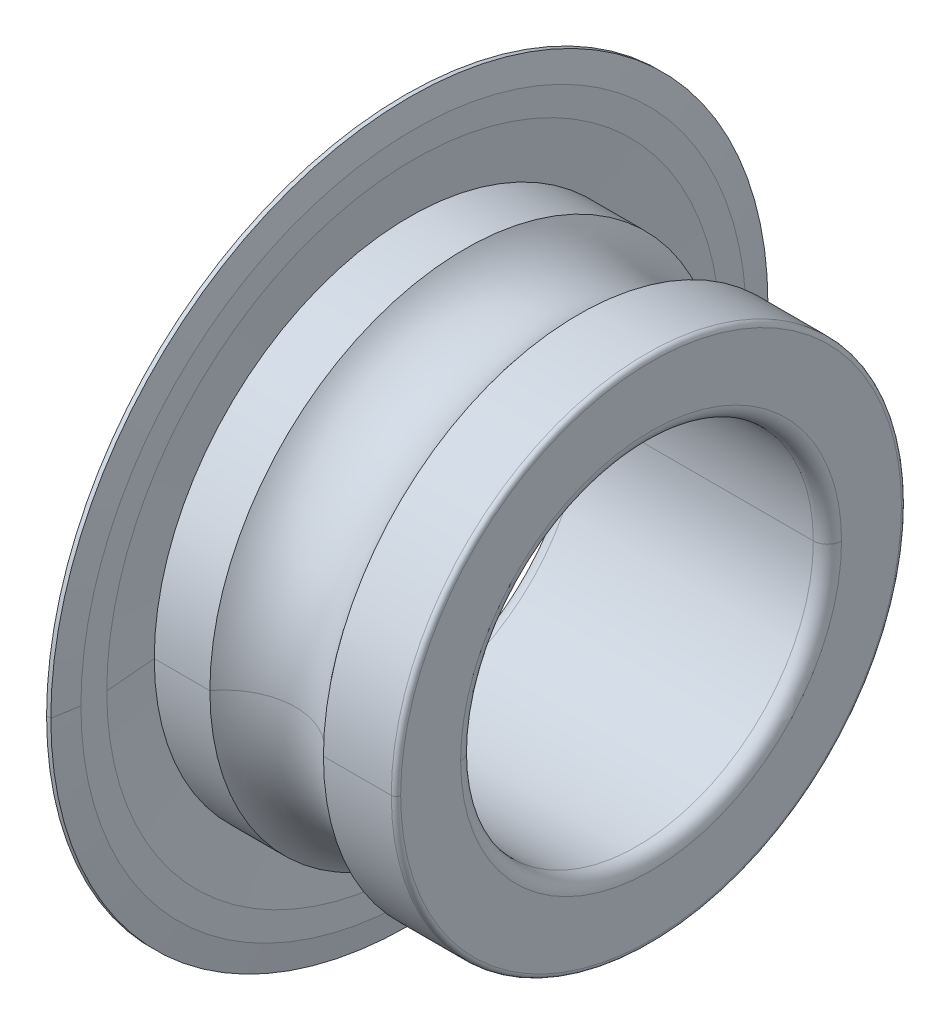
ISO-10303-21;
HEADER;
FILE_DESCRIPTION(('STEP AP214'),'2;1');
FILE_NAME('part.step','',(''),(''),'','','');
FILE_SCHEMA(('AUTOMOTIVE_DESIGN { 1 0 10303 214 1 1 1 1 }'));
ENDSEC;
DATA;
#1=APPLICATION_CONTEXT('core data for automotive mechanical design processes');
#2=APPLICATION_PROTOCOL_DEFINITION('international standard','automotive_design',2000,#1);
#3=PRODUCT_CONTEXT('',#1,'mechanical');
#4=PRODUCT('Part','Part','',(#3));
#5=PRODUCT_RELATED_PRODUCT_CATEGORY('part','',(#4));
#6=PRODUCT_DEFINITION_FORMATION('','',#4);
#7=PRODUCT_DEFINITION_CONTEXT('part definition',#1,'design');
#8=PRODUCT_DEFINITION('design','',#6,#7);
#9=PRODUCT_DEFINITION_SHAPE('','',#8);
#10=(LENGTH_UNIT() NAMED_UNIT(*) SI_UNIT(.MILLI.,.METRE.));
#11=(NAMED_UNIT(*) PLANE_ANGLE_UNIT() SI_UNIT($,.RADIAN.));
#12=(NAMED_UNIT(*) SI_UNIT($,.STERADIAN.) SOLID_ANGLE_UNIT());
#13=UNCERTAINTY_MEASURE_WITH_UNIT(LENGTH_MEASURE(1.E-05),#10,'distance_accuracy_value','');
#14=(GEOMETRIC_REPRESENTATION_CONTEXT(3) GLOBAL_UNCERTAINTY_ASSIGNED_CONTEXT((#13)) GLOBAL_UNIT_ASSIGNED_CONTEXT((#10,
#11,#12)) REPRESENTATION_CONTEXT('',''));
#15=CARTESIAN_POINT('',(0.,0.,0.));
#16=DIRECTION('',(0.,0.,1.));
#17=DIRECTION('',(1.,0.,0.));
#18=AXIS2_PLACEMENT_3D('',#15,#16,#17);
#19=CARTESIAN_POINT('',(50.,0.,0.));
#20=DIRECTION('',(-1.,0.,0.));
#21=DIRECTION('',(0.,1.,0.));
#22=AXIS2_PLACEMENT_3D('',#19,#20,#21);
#23=CYLINDRICAL_SURFACE('',#22,15.25);
#24=CARTESIAN_POINT('',(0.539999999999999,0.,0.));
#25=DIRECTION('',(1.,0.,0.));
#26=DIRECTION('',(0.,0.,-1.));
#27=AXIS2_PLACEMENT_3D('',#24,#25,#26);
#28=CIRCLE('',#27,15.25);
#29=CARTESIAN_POINT('',(0.539999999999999,0.,15.25));
#30=VERTEX_POINT('',#29);
#31=CARTESIAN_POINT('',(0.539999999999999,0.,-15.25));
#32=VERTEX_POINT('',#31);
#33=EDGE_CURVE('E11',#30,#32,#28,.T.);
#34=ORIENTED_EDGE('',*,*,#33,.T.);
#35=DIRECTION('',(-1.,0.,0.));
#36=VECTOR('',#35,1.);
#37=CARTESIAN_POINT('',(0.719999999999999,0.,-15.25));
#38=LINE('',#37,#36);
#39=CARTESIAN_POINT('',(0.719999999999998,0.,-15.25));
#40=VERTEX_POINT('',#39);
#41=EDGE_CURVE('E24',#40,#32,#38,.T.);
#42=ORIENTED_EDGE('',*,*,#41,.F.);
#43=CARTESIAN_POINT('',(0.719999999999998,0.,0.));
#44=DIRECTION('',(1.,0.,0.));
#45=DIRECTION('',(0.,0.,-1.));
#46=AXIS2_PLACEMENT_3D('',#43,#44,#45);
#47=CIRCLE('',#46,15.25);
#48=CARTESIAN_POINT('',(0.719999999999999,0.,15.25));
#49=VERTEX_POINT('',#48);
#50=EDGE_CURVE('E149',#49,#40,#47,.T.);
#51=ORIENTED_EDGE('',*,*,#50,.F.);
#52=DIRECTION('',(-1.,0.,0.));
#53=VECTOR('',#52,1.);
#54=CARTESIAN_POINT('',(0.719999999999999,0.,15.25));
#55=LINE('',#54,#53);
#56=EDGE_CURVE('E648',#49,#30,#55,.T.);
#57=ORIENTED_EDGE('',*,*,#56,.T.);
#58=EDGE_LOOP('',(#34,#42,#51,#57));
#59=FACE_BOUND('',#58,.T.);
#60=ADVANCED_FACE('F16',(#59),#23,.T.);
#61=CARTESIAN_POINT('',(50.,0.,0.));
#62=DIRECTION('',(-1.,0.,0.));
#63=DIRECTION('',(0.,-1.,0.));
#64=AXIS2_PLACEMENT_3D('',#61,#62,#63);
#65=CYLINDRICAL_SURFACE('',#64,15.25);
#66=CARTESIAN_POINT('',(0.719999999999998,0.,0.));
#67=DIRECTION('',(1.,0.,0.));
#68=DIRECTION('',(0.,0.,-1.));
#69=AXIS2_PLACEMENT_3D('',#66,#67,#68);
#70=CIRCLE('',#69,15.25);
#71=EDGE_CURVE('E644',#40,#49,#70,.T.);
#72=ORIENTED_EDGE('',*,*,#71,.F.);
#73=ORIENTED_EDGE('',*,*,#41,.T.);
#74=CARTESIAN_POINT('',(0.539999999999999,0.,0.));
#75=DIRECTION('',(1.,0.,0.));
#76=DIRECTION('',(0.,0.,-1.));
#77=AXIS2_PLACEMENT_3D('',#74,#75,#76);
#78=CIRCLE('',#77,15.25);
#79=EDGE_CURVE('E639',#32,#30,#78,.T.);
#80=ORIENTED_EDGE('',*,*,#79,.T.);
#81=ORIENTED_EDGE('',*,*,#56,.F.);
#82=EDGE_LOOP('',(#72,#73,#80,#81));
#83=FACE_BOUND('',#82,.T.);
#84=ADVANCED_FACE('F661',(#83),#65,.T.);
#85=CARTESIAN_POINT('',(0.539999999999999,0.,0.));
#86=DIRECTION('',(-1.,0.,0.));
#87=DIRECTION('',(0.,-1.,0.));
#88=AXIS2_PLACEMENT_3D('',#85,#86,#87);
#89=CONICAL_SURFACE('',#88,15.25,1.4891599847);
#90=CARTESIAN_POINT('',(0.629999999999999,0.,0.));
#91=DIRECTION('',(1.,0.,0.));
#92=DIRECTION('',(0.,0.,-1.));
#93=AXIS2_PLACEMENT_3D('',#90,#91,#92);
#94=CIRCLE('',#93,14.15);
#95=CARTESIAN_POINT('',(0.629999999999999,0.,-14.15));
#96=VERTEX_POINT('',#95);
#97=CARTESIAN_POINT('',(0.629999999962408,0.,14.1499999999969));
#98=VERTEX_POINT('',#97);
#99=EDGE_CURVE('E635',#96,#98,#94,.T.);
#100=ORIENTED_EDGE('',*,*,#99,.T.);
#101=DIRECTION('',(-0.0815456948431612,0.,0.996669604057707));
#102=VECTOR('',#101,1.);
#103=CARTESIAN_POINT('',(0.629999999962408,0.,14.1499999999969));
#104=LINE('',#103,#102);
#105=EDGE_CURVE('E630',#98,#30,#104,.T.);
#106=ORIENTED_EDGE('',*,*,#105,.T.);
#107=ORIENTED_EDGE('',*,*,#79,.F.);
#108=DIRECTION('',(-0.0815456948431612,0.,-0.996669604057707));
#109=VECTOR('',#108,1.);
#110=CARTESIAN_POINT('',(0.629999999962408,0.,-14.1499999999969));
#111=LINE('',#110,#109);
#112=EDGE_CURVE('E625',#96,#32,#111,.T.);
#113=ORIENTED_EDGE('',*,*,#112,.F.);
#114=EDGE_LOOP('',(#100,#106,#107,#113));
#115=FACE_BOUND('',#114,.T.);
#116=ADVANCED_FACE('F664',(#115),#89,.F.);
#117=CARTESIAN_POINT('',(0.539999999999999,0.,0.));
#118=DIRECTION('',(-1.,0.,0.));
#119=DIRECTION('',(0.,1.,0.));
#120=AXIS2_PLACEMENT_3D('',#117,#118,#119);
#121=CONICAL_SURFACE('',#120,15.25,1.4891599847);
#122=ORIENTED_EDGE('',*,*,#33,.F.);
#123=ORIENTED_EDGE('',*,*,#105,.F.);
#124=CARTESIAN_POINT('',(0.629999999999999,0.,0.));
#125=DIRECTION('',(1.,0.,0.));
#126=DIRECTION('',(0.,0.,-1.));
#127=AXIS2_PLACEMENT_3D('',#124,#125,#126);
#128=CIRCLE('',#127,14.15);
#129=EDGE_CURVE('E620',#98,#96,#128,.T.);
#130=ORIENTED_EDGE('',*,*,#129,.T.);
#131=ORIENTED_EDGE('',*,*,#112,.T.);
#132=EDGE_LOOP('',(#122,#123,#130,#131));
#133=FACE_BOUND('',#132,.T.);
#134=ADVANCED_FACE('F667',(#133),#121,.F.);
#135=CARTESIAN_POINT('',(0.629999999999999,0.,0.));
#136=DIRECTION('',(1.,0.,0.));
#137=DIRECTION('',(0.,1.,0.));
#138=AXIS2_PLACEMENT_3D('',#135,#136,#137);
#139=CONICAL_SURFACE('',#138,14.15,1.4891599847);
#140=CARTESIAN_POINT('',(0.539999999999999,0.,0.));
#141=DIRECTION('',(1.,0.,0.));
#142=DIRECTION('',(0.,0.,-1.));
#143=AXIS2_PLACEMENT_3D('',#140,#141,#142);
#144=CIRCLE('',#143,13.05);
#145=CARTESIAN_POINT('',(0.54000000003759,0.,13.0499999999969));
#146=VERTEX_POINT('',#145);
#147=CARTESIAN_POINT('',(0.539999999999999,0.,-13.05));
#148=VERTEX_POINT('',#147);
#149=EDGE_CURVE('E616',#146,#148,#144,.T.);
#150=ORIENTED_EDGE('',*,*,#149,.T.);
#151=DIRECTION('',(0.081545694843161,0.,-0.996669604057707));
#152=VECTOR('',#151,1.);
#153=CARTESIAN_POINT('',(0.54000000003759,0.,-13.0499999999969));
#154=LINE('',#153,#152);
#155=EDGE_CURVE('E611',#148,#96,#154,.T.);
#156=ORIENTED_EDGE('',*,*,#155,.T.);
#157=ORIENTED_EDGE('',*,*,#129,.F.);
#158=DIRECTION('',(0.081545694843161,0.,0.996669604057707));
#159=VECTOR('',#158,1.);
#160=CARTESIAN_POINT('',(0.54000000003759,0.,13.0499999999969));
#161=LINE('',#160,#159);
#162=EDGE_CURVE('E606',#146,#98,#161,.T.);
#163=ORIENTED_EDGE('',*,*,#162,.F.);
#164=EDGE_LOOP('',(#150,#156,#157,#163));
#165=FACE_BOUND('',#164,.T.);
#166=ADVANCED_FACE('F672',(#165),#139,.T.);
#167=CARTESIAN_POINT('',(0.629999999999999,0.,0.));
#168=DIRECTION('',(1.,0.,0.));
#169=DIRECTION('',(0.,-1.,0.));
#170=AXIS2_PLACEMENT_3D('',#167,#168,#169);
#171=CONICAL_SURFACE('',#170,14.15,1.4891599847);
#172=ORIENTED_EDGE('',*,*,#99,.F.);
#173=ORIENTED_EDGE('',*,*,#155,.F.);
#174=CARTESIAN_POINT('',(0.539999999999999,0.,0.));
#175=DIRECTION('',(1.,0.,0.));
#176=DIRECTION('',(0.,0.,-1.));
#177=AXIS2_PLACEMENT_3D('',#174,#175,#176);
#178=CIRCLE('',#177,13.05);
#179=EDGE_CURVE('E601',#148,#146,#178,.T.);
#180=ORIENTED_EDGE('',*,*,#179,.T.);
#181=ORIENTED_EDGE('',*,*,#162,.T.);
#182=EDGE_LOOP('',(#172,#173,#180,#181));
#183=FACE_BOUND('',#182,.T.);
#184=ADVANCED_FACE('F676',(#183),#171,.T.);
#185=CARTESIAN_POINT('',(0.54,13.05,0.));
#186=DIRECTION('',(-1.,0.,0.));
#187=DIRECTION('',(0.,0.,1.));
#188=AXIS2_PLACEMENT_3D('',#185,#186,#187);
#189=PLANE('',#188);
#190=CARTESIAN_POINT('',(0.539999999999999,0.,0.));
#191=DIRECTION('',(1.,0.,0.));
#192=DIRECTION('',(0.,0.,-1.));
#193=AXIS2_PLACEMENT_3D('',#190,#191,#192);
#194=CIRCLE('',#193,10.85);
#195=CARTESIAN_POINT('',(0.539999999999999,0.,-10.85));
#196=VERTEX_POINT('',#195);
#197=CARTESIAN_POINT('',(0.539999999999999,0.,10.85));
#198=VERTEX_POINT('',#197);
#199=EDGE_CURVE('E597',#196,#198,#194,.T.);
#200=ORIENTED_EDGE('',*,*,#199,.T.);
#201=CARTESIAN_POINT('',(0.539999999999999,0.,0.));
#202=DIRECTION('',(1.,0.,0.));
#203=DIRECTION('',(0.,0.,-1.));
#204=AXIS2_PLACEMENT_3D('',#201,#202,#203);
#205=CIRCLE('',#204,10.85);
#206=EDGE_CURVE('E593',#198,#196,#205,.T.);
#207=ORIENTED_EDGE('',*,*,#206,.T.);
#208=EDGE_LOOP('',(#200,#207));
#209=FACE_BOUND('',#208,.T.);
#210=ORIENTED_EDGE('',*,*,#179,.F.);
#211=ORIENTED_EDGE('',*,*,#149,.F.);
#212=EDGE_LOOP('',(#210,#211));
#213=FACE_BOUND('',#212,.T.);
#214=ADVANCED_FACE('F678',(#209,#213),#189,.T.);
#215=CARTESIAN_POINT('',(50.,0.,0.));
#216=DIRECTION('',(-1.,0.,0.));
#217=DIRECTION('',(0.,1.,0.));
#218=AXIS2_PLACEMENT_3D('',#215,#216,#217);
#219=CYLINDRICAL_SURFACE('',#218,10.85);
#220=CARTESIAN_POINT('',(0.199999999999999,0.,0.));
#221=DIRECTION('',(1.,0.,0.));
#222=DIRECTION('',(0.,0.,-1.));
#223=AXIS2_PLACEMENT_3D('',#220,#221,#222);
#224=CIRCLE('',#223,10.85);
#225=CARTESIAN_POINT('',(0.199999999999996,0.,10.85));
#226=VERTEX_POINT('',#225);
#227=CARTESIAN_POINT('',(0.199999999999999,0.,-10.85));
#228=VERTEX_POINT('',#227);
#229=EDGE_CURVE('E589',#226,#228,#224,.T.);
#230=ORIENTED_EDGE('',*,*,#229,.T.);
#231=DIRECTION('',(-1.,0.,0.));
#232=VECTOR('',#231,1.);
#233=CARTESIAN_POINT('',(0.539999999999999,0.,-10.85));
#234=LINE('',#233,#232);
#235=EDGE_CURVE('E584',#196,#228,#234,.T.);
#236=ORIENTED_EDGE('',*,*,#235,.F.);
#237=ORIENTED_EDGE('',*,*,#206,.F.);
#238=DIRECTION('',(-1.,0.,0.));
#239=VECTOR('',#238,1.);
#240=CARTESIAN_POINT('',(0.539999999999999,0.,10.85));
#241=LINE('',#240,#239);
#242=EDGE_CURVE('E580',#198,#226,#241,.T.);
#243=ORIENTED_EDGE('',*,*,#242,.T.);
#244=EDGE_LOOP('',(#230,#236,#237,#243));
#245=FACE_BOUND('',#244,.T.);
#246=ADVANCED_FACE('F680',(#245),#219,.T.);
#247=CARTESIAN_POINT('',(50.,0.,0.));
#248=DIRECTION('',(-1.,0.,0.));
#249=DIRECTION('',(0.,-1.,0.));
#250=AXIS2_PLACEMENT_3D('',#247,#248,#249);
#251=CYLINDRICAL_SURFACE('',#250,10.85);
#252=ORIENTED_EDGE('',*,*,#199,.F.);
#253=ORIENTED_EDGE('',*,*,#235,.T.);
#254=CARTESIAN_POINT('',(0.199999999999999,0.,0.));
#255=DIRECTION('',(1.,0.,0.));
#256=DIRECTION('',(0.,0.,-1.));
#257=AXIS2_PLACEMENT_3D('',#254,#255,#256);
#258=CIRCLE('',#257,10.85);
#259=EDGE_CURVE('E577',#228,#226,#258,.T.);
#260=ORIENTED_EDGE('',*,*,#259,.T.);
#261=ORIENTED_EDGE('',*,*,#242,.F.);
#262=EDGE_LOOP('',(#252,#253,#260,#261));
#263=FACE_BOUND('',#262,.T.);
#264=ADVANCED_FACE('F688',(#263),#251,.T.);
#265=CARTESIAN_POINT('',(0.200000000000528,0.,0.));
#266=DIRECTION('',(1.,0.,0.));
#267=DIRECTION('',(0.,-1.,0.));
#268=AXIS2_PLACEMENT_3D('',#265,#266,#267);
#269=TOROIDAL_SURFACE('',#268,10.65,0.2);
#270=ORIENTED_EDGE('',*,*,#259,.F.);
#271=CARTESIAN_POINT('',(5.28006458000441E-13,0.,-10.65));
#272=CARTESIAN_POINT('',(-6.94172270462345E-08,0.,-10.6532724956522));
#273=CARTESIAN_POINT('',(8.03165754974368E-05,0.,-10.6565449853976));
#274=CARTESIAN_POINT('',(0.00040150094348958,0.,-10.6630820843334));
#275=CARTESIAN_POINT('',(0.00064229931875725,0.,-10.6663466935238));
#276=CARTESIAN_POINT('',(0.00128381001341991,0.,-10.6728601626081));
#277=CARTESIAN_POINT('',(0.00168452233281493,0.,-10.6761090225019));
#278=CARTESIAN_POINT('',(0.00264487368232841,0.,-10.6825831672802));
#279=CARTESIAN_POINT('',(0.00320451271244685,0.,-10.6858084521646));
#280=CARTESIAN_POINT('',(0.00448137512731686,0.,-10.6922276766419));
#281=CARTESIAN_POINT('',(0.00519859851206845,0.,-10.6954216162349));
#282=CARTESIAN_POINT('',(0.0067889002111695,0.,-10.7017704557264));
#283=CARTESIAN_POINT('',(0.00766197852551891,0.,-10.704925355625));
#284=CARTESIAN_POINT('',(0.0095618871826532,0.,-10.7111885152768));
#285=CARTESIAN_POINT('',(0.0105887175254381,0.,-10.7142967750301));
#286=CARTESIAN_POINT('',(0.0127936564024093,0.,-10.7204591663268));
#287=CARTESIAN_POINT('',(0.0139717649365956,0.,-10.7235132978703));
#288=CARTESIAN_POINT('',(0.0164764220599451,0.,-10.7295600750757));
#289=CARTESIAN_POINT('',(0.0178029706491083,0.,-10.7325527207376));
#290=CARTESIAN_POINT('',(0.0206013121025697,0.,-10.7384693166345));
#291=CARTESIAN_POINT('',(0.0220731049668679,0.,-10.7413932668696));
#292=CARTESIAN_POINT('',(0.0251583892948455,0.,-10.7471654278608));
#293=CARTESIAN_POINT('',(0.0267718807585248,0.,-10.7500136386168));
#294=CARTESIAN_POINT('',(0.0301366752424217,0.,-10.7556274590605));
#295=CARTESIAN_POINT('',(0.0318879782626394,0.,-10.7583930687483));
#296=CARTESIAN_POINT('',(0.0355241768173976,0.,-10.7638350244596));
#297=CARTESIAN_POINT('',(0.0374090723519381,0.,-10.7665113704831));
#298=CARTESIAN_POINT('',(0.0413079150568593,0.,-10.7717683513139));
#299=CARTESIAN_POINT('',(0.04332186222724,0.,-10.7743489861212));
#300=CARTESIAN_POINT('',(0.0474739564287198,0.,-10.7794083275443));
#301=CARTESIAN_POINT('',(0.0496121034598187,0.,-10.7818870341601));
#302=CARTESIAN_POINT('',(0.054007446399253,0.,-10.7867365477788));
#303=CARTESIAN_POINT('',(0.0562646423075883,0.,-10.7891073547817));
#304=CARTESIAN_POINT('',(0.0608926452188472,0.,-10.7937353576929));
#305=CARTESIAN_POINT('',(0.0632634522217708,0.,-10.7959925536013));
#306=CARTESIAN_POINT('',(0.0681129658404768,0.,-10.8003878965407));
#307=CARTESIAN_POINT('',(0.0705916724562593,0.,-10.8025260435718));
#308=CARTESIAN_POINT('',(0.0756510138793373,0.,-10.8066781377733));
#309=CARTESIAN_POINT('',(0.0782316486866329,0.,-10.8086920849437));
#310=CARTESIAN_POINT('',(0.0834886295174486,0.,-10.8125909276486));
#311=CARTESIAN_POINT('',(0.0861649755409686,0.,-10.8144758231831));
#312=CARTESIAN_POINT('',(0.091606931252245,0.,-10.8181120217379));
#313=CARTESIAN_POINT('',(0.0943725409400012,0.,-10.8198633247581));
#314=CARTESIAN_POINT('',(0.0999863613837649,0.,-10.823228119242));
#315=CARTESIAN_POINT('',(0.102834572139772,0.,-10.8248416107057));
#316=CARTESIAN_POINT('',(0.108606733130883,0.,-10.8279268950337));
#317=CARTESIAN_POINT('',(0.111530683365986,0.,-10.829398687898));
#318=CARTESIAN_POINT('',(0.117447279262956,0.,-10.8321970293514));
#319=CARTESIAN_POINT('',(0.120439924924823,0.,-10.8335235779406));
#320=CARTESIAN_POINT('',(0.126486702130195,0.,-10.8360282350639));
#321=CARTESIAN_POINT('',(0.129540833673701,0.,-10.8372063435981));
#322=CARTESIAN_POINT('',(0.135703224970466,0.,-10.8394112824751));
#323=CARTESIAN_POINT('',(0.138811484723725,0.,-10.8404381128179));
#324=CARTESIAN_POINT('',(0.145074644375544,0.,-10.842338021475));
#325=CARTESIAN_POINT('',(0.148229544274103,0.,-10.8432110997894));
#326=CARTESIAN_POINT('',(0.154578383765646,0.,-10.8448014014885));
#327=CARTESIAN_POINT('',(0.157772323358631,0.,-10.8455186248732));
#328=CARTESIAN_POINT('',(0.164191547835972,0.,-10.8467954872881));
#329=CARTESIAN_POINT('',(0.167416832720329,0.,-10.8473551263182));
#330=CARTESIAN_POINT('',(0.17389097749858,0.,-10.8483154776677));
#331=CARTESIAN_POINT('',(0.177139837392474,0.,-10.8487161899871));
#332=CARTESIAN_POINT('',(0.183653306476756,0.,-10.8493577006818));
#333=CARTESIAN_POINT('',(0.186917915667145,0.,-10.849598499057));
#334=CARTESIAN_POINT('',(0.193455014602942,0.,-10.849919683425));
#335=CARTESIAN_POINT('',(0.196727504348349,0.,-10.8500000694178));
#336=CARTESIAN_POINT('',(0.200000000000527,0.,-10.85));
#337=B_SPLINE_CURVE_WITH_KNOTS('',3,(#271,#272,#273,#274,#275,#276,#277,#278,#279,#280,#281,
#282,#283,#284,#285,#286,#287,#288,#289,#290,#291,#292,#293,#294,#295,#296,#297,#298,#299,#300,
#301,#302,#303,#304,#305,#306,#307,#308,#309,#310,#311,#312,#313,#314,#315,#316,#317,#318,#319,
#320,#321,#322,#323,#324,#325,#326,#327,#328,#329,#330,#331,#332,#333,#334,#335,#336),
.UNSPECIFIED.,.F.,.F.,(4,2,2,2,2,2,2,2,2,2,2,2,2,2,2,2,2,2,2,2,2,2,2,2,2,2,2,2,2,2,2,2,4),(0.,
0.00981649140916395,0.0196329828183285,0.0294494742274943,0.0392659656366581,0.049082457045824,
0.0588989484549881,0.0687154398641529,0.0785319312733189,0.0883484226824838,0.0981649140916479,
0.107981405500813,0.117797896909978,0.127614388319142,0.137430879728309,0.147247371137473,
0.157063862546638,0.166880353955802,0.176696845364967,0.186513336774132,0.196329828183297,
0.206146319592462,0.215962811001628,0.225779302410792,0.235595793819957,0.245412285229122,
0.255228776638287,0.265045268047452,0.274861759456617,0.284678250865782,0.294494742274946,
0.304311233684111,0.314127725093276),.UNSPECIFIED.);
#338=CARTESIAN_POINT('',(0.,0.,-10.65));
#339=VERTEX_POINT('',#338);
#340=EDGE_CURVE('E547',#339,#228,#337,.T.);
#341=ORIENTED_EDGE('',*,*,#340,.F.);
#342=CARTESIAN_POINT('',(0.,0.,0.));
#343=DIRECTION('',(1.,0.,0.));
#344=DIRECTION('',(0.,0.,-1.));
#345=AXIS2_PLACEMENT_3D('',#342,#343,#344);
#346=CIRCLE('',#345,10.65);
#347=CARTESIAN_POINT('',(5.27994314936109E-13,0.,10.65));
#348=VERTEX_POINT('',#347);
#349=EDGE_CURVE('E564',#339,#348,#346,.T.);
#350=ORIENTED_EDGE('',*,*,#349,.T.);
#351=CARTESIAN_POINT('',(5.28006458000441E-13,0.,10.65));
#352=CARTESIAN_POINT('',(-6.94172270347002E-08,0.,10.6532724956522));
#353=CARTESIAN_POINT('',(8.03165754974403E-05,0.,10.6565449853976));
#354=CARTESIAN_POINT('',(0.000401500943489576,0.,10.6630820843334));
#355=CARTESIAN_POINT('',(0.000642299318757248,0.,10.6663466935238));
#356=CARTESIAN_POINT('',(0.00128381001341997,0.,10.6728601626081));
#357=CARTESIAN_POINT('',(0.00168452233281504,0.,10.6761090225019));
#358=CARTESIAN_POINT('',(0.00264487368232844,0.,10.6825831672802));
#359=CARTESIAN_POINT('',(0.00320451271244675,0.,10.6858084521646));
#360=CARTESIAN_POINT('',(0.00448137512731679,0.,10.6922276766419));
#361=CARTESIAN_POINT('',(0.00519859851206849,0.,10.6954216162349));
#362=CARTESIAN_POINT('',(0.00678890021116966,0.,10.7017704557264));
#363=CARTESIAN_POINT('',(0.00766197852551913,0.,10.704925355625));
#364=CARTESIAN_POINT('',(0.00956188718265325,0.,10.7111885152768));
#365=CARTESIAN_POINT('',(0.0105887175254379,0.,10.7142967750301));
#366=CARTESIAN_POINT('',(0.0127936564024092,0.,10.7204591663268));
#367=CARTESIAN_POINT('',(0.0139717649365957,0.,10.7235132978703));
#368=CARTESIAN_POINT('',(0.0164764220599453,0.,10.7295600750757));
#369=CARTESIAN_POINT('',(0.0178029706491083,0.,10.7325527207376));
#370=CARTESIAN_POINT('',(0.0206013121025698,0.,10.7384693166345));
#371=CARTESIAN_POINT('',(0.0220731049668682,0.,10.7413932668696));
#372=CARTESIAN_POINT('',(0.0251583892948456,0.,10.7471654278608));
#373=CARTESIAN_POINT('',(0.0267718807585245,0.,10.7500136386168));
#374=CARTESIAN_POINT('',(0.0301366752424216,0.,10.7556274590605));
#375=CARTESIAN_POINT('',(0.0318879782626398,0.,10.7583930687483));
#376=CARTESIAN_POINT('',(0.0355241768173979,0.,10.7638350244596));
#377=CARTESIAN_POINT('',(0.037409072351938,0.,10.7665113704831));
#378=CARTESIAN_POINT('',(0.0413079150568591,0.,10.7717683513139));
#379=CARTESIAN_POINT('',(0.0433218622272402,0.,10.7743489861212));
#380=CARTESIAN_POINT('',(0.0474739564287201,0.,10.7794083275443));
#381=CARTESIAN_POINT('',(0.0496121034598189,0.,10.7818870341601));
#382=CARTESIAN_POINT('',(0.054007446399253,0.,10.7867365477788));
#383=CARTESIAN_POINT('',(0.0562646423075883,0.,10.7891073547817));
#384=CARTESIAN_POINT('',(0.0608926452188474,0.,10.7937353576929));
#385=CARTESIAN_POINT('',(0.0632634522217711,0.,10.7959925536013));
#386=CARTESIAN_POINT('',(0.068112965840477,0.,10.8003878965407));
#387=CARTESIAN_POINT('',(0.0705916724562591,0.,10.8025260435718));
#388=CARTESIAN_POINT('',(0.0756510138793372,0.,10.8066781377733));
#389=CARTESIAN_POINT('',(0.0782316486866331,0.,10.8086920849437));
#390=CARTESIAN_POINT('',(0.0834886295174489,0.,10.8125909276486));
#391=CARTESIAN_POINT('',(0.0861649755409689,0.,10.8144758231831));
#392=CARTESIAN_POINT('',(0.091606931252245,0.,10.8181120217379));
#393=CARTESIAN_POINT('',(0.0943725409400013,0.,10.8198633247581));
#394=CARTESIAN_POINT('',(0.0999863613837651,0.,10.823228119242));
#395=CARTESIAN_POINT('',(0.102834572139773,0.,10.8248416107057));
#396=CARTESIAN_POINT('',(0.108606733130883,0.,10.8279268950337));
#397=CARTESIAN_POINT('',(0.111530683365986,0.,10.829398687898));
#398=CARTESIAN_POINT('',(0.117447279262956,0.,10.8321970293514));
#399=CARTESIAN_POINT('',(0.120439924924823,0.,10.8335235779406));
#400=CARTESIAN_POINT('',(0.126486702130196,0.,10.8360282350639));
#401=CARTESIAN_POINT('',(0.129540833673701,0.,10.8372063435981));
#402=CARTESIAN_POINT('',(0.135703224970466,0.,10.8394112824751));
#403=CARTESIAN_POINT('',(0.138811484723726,0.,10.8404381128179));
#404=CARTESIAN_POINT('',(0.145074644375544,0.,10.842338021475));
#405=CARTESIAN_POINT('',(0.148229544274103,0.,10.8432110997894));
#406=CARTESIAN_POINT('',(0.154578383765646,0.,10.8448014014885));
#407=CARTESIAN_POINT('',(0.157772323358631,0.,10.8455186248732));
#408=CARTESIAN_POINT('',(0.164191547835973,0.,10.8467954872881));
#409=CARTESIAN_POINT('',(0.16741683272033,0.,10.8473551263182));
#410=CARTESIAN_POINT('',(0.17389097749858,0.,10.8483154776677));
#411=CARTESIAN_POINT('',(0.177139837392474,0.,10.8487161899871));
#412=CARTESIAN_POINT('',(0.183653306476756,0.,10.8493577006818));
#413=CARTESIAN_POINT('',(0.186917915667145,0.,10.849598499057));
#414=CARTESIAN_POINT('',(0.193455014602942,0.,10.849919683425));
#415=CARTESIAN_POINT('',(0.196727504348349,0.,10.8500000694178));
#416=CARTESIAN_POINT('',(0.200000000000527,0.,10.85));
#417=B_SPLINE_CURVE_WITH_KNOTS('',3,(#351,#352,#353,#354,#355,#356,#357,#358,#359,#360,#361,
#362,#363,#364,#365,#366,#367,#368,#369,#370,#371,#372,#373,#374,#375,#376,#377,#378,#379,#380,
#381,#382,#383,#384,#385,#386,#387,#388,#389,#390,#391,#392,#393,#394,#395,#396,#397,#398,#399,
#400,#401,#402,#403,#404,#405,#406,#407,#408,#409,#410,#411,#412,#413,#414,#415,#416),
.UNSPECIFIED.,.F.,.F.,(4,2,2,2,2,2,2,2,2,2,2,2,2,2,2,2,2,2,2,2,2,2,2,2,2,2,2,2,2,2,2,2,4),(0.,
0.00981649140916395,0.0196329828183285,0.0294494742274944,0.0392659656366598,0.049082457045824,
0.0588989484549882,0.0687154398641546,0.078531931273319,0.0883484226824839,0.098164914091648,
0.107981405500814,0.117797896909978,0.127614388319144,0.137430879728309,0.147247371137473,
0.157063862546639,0.166880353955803,0.176696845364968,0.186513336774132,0.196329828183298,
0.206146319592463,0.215962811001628,0.225779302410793,0.235595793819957,0.245412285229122,
0.255228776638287,0.265045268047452,0.274861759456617,0.284678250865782,0.294494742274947,
0.304311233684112,0.314127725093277),.UNSPECIFIED.);
#418=EDGE_CURVE('E549',#348,#226,#417,.T.);
#419=ORIENTED_EDGE('',*,*,#418,.T.);
#420=EDGE_LOOP('',(#270,#341,#350,#419));
#421=FACE_BOUND('',#420,.T.);
#422=ADVANCED_FACE('F530',(#421),#269,.T.);
#423=CARTESIAN_POINT('',(0.200000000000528,0.,0.));
#424=DIRECTION('',(1.,0.,0.));
#425=DIRECTION('',(0.,1.,0.));
#426=AXIS2_PLACEMENT_3D('',#423,#424,#425);
#427=TOROIDAL_SURFACE('',#426,10.65,0.2);
#428=CARTESIAN_POINT('',(0.,0.,0.));
#429=DIRECTION('',(1.,0.,0.));
#430=DIRECTION('',(0.,0.,-1.));
#431=AXIS2_PLACEMENT_3D('',#428,#429,#430);
#432=CIRCLE('',#431,10.65);
#433=EDGE_CURVE('E511',#348,#339,#432,.T.);
#434=ORIENTED_EDGE('',*,*,#433,.T.);
#435=ORIENTED_EDGE('',*,*,#340,.T.);
#436=ORIENTED_EDGE('',*,*,#229,.F.);
#437=ORIENTED_EDGE('',*,*,#418,.F.);
#438=EDGE_LOOP('',(#434,#435,#436,#437));
#439=FACE_BOUND('',#438,.T.);
#440=ADVANCED_FACE('F520',(#439),#427,.T.);
#441=CARTESIAN_POINT('',(0.,10.65,0.));
#442=DIRECTION('',(-1.,0.,0.));
#443=DIRECTION('',(0.,0.,1.));
#444=AXIS2_PLACEMENT_3D('',#441,#442,#443);
#445=PLANE('',#444);
#446=CARTESIAN_POINT('',(0.,0.,0.));
#447=DIRECTION('',(1.,0.,0.));
#448=DIRECTION('',(0.,0.,-1.));
#449=AXIS2_PLACEMENT_3D('',#446,#447,#448);
#450=CIRCLE('',#449,8.1);
#451=CARTESIAN_POINT('',(0.,0.,-8.1));
#452=VERTEX_POINT('',#451);
#453=CARTESIAN_POINT('',(0.,0.,8.1));
#454=VERTEX_POINT('',#453);
#455=EDGE_CURVE('E507',#452,#454,#450,.T.);
#456=ORIENTED_EDGE('',*,*,#455,.T.);
#457=CARTESIAN_POINT('',(0.,0.,0.));
#458=DIRECTION('',(1.,0.,0.));
#459=DIRECTION('',(0.,0.,-1.));
#460=AXIS2_PLACEMENT_3D('',#457,#458,#459);
#461=CIRCLE('',#460,8.1);
#462=EDGE_CURVE('E503',#454,#452,#461,.T.);
#463=ORIENTED_EDGE('',*,*,#462,.T.);
#464=EDGE_LOOP('',(#456,#463));
#465=FACE_BOUND('',#464,.T.);
#466=ORIENTED_EDGE('',*,*,#349,.F.);
#467=ORIENTED_EDGE('',*,*,#433,.F.);
#468=EDGE_LOOP('',(#466,#467));
#469=FACE_BOUND('',#468,.T.);
#470=ADVANCED_FACE('F529',(#465,#469),#445,.T.);
#471=CARTESIAN_POINT('',(0.600000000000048,0.,0.));
#472=DIRECTION('',(1.,0.,0.));
#473=DIRECTION('',(0.,1.,0.));
#474=AXIS2_PLACEMENT_3D('',#471,#472,#473);
#475=TOROIDAL_SURFACE('',#474,8.1,0.6);
#476=CARTESIAN_POINT('',(0.599999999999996,0.,0.));
#477=DIRECTION('',(1.,0.,0.));
#478=DIRECTION('',(0.,0.,-1.));
#479=AXIS2_PLACEMENT_3D('',#476,#477,#478);
#480=CIRCLE('',#479,7.5);
#481=CARTESIAN_POINT('',(0.599999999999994,0.,7.5));
#482=VERTEX_POINT('',#481);
#483=CARTESIAN_POINT('',(0.599999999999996,0.,-7.5));
#484=VERTEX_POINT('',#483);
#485=EDGE_CURVE('E501',#482,#484,#480,.T.);
#486=ORIENTED_EDGE('',*,*,#485,.T.);
#487=CARTESIAN_POINT('',(0.599999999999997,0.,-7.5));
#488=CARTESIAN_POINT('',(0.590182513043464,0.,-7.49999979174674));
#489=CARTESIAN_POINT('',(0.580365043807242,0.,-7.50024094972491));
#490=CARTESIAN_POINT('',(0.560753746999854,0.,-7.50120450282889));
#491=CARTESIAN_POINT('',(0.550959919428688,0.,-7.50192689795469));
#492=CARTESIAN_POINT('',(0.531419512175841,0.,-7.50385143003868));
#493=CARTESIAN_POINT('',(0.521672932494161,0.,-7.50505356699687));
#494=CARTESIAN_POINT('',(0.50225049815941,0.,-7.50793462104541));
#495=CARTESIAN_POINT('',(0.49257464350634,0.,-7.50961353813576));
#496=CARTESIAN_POINT('',(0.473316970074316,0.,-7.51344412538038));
#497=CARTESIAN_POINT('',(0.463735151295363,0.,-7.51559579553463));
#498=CARTESIAN_POINT('',(0.444688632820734,0.,-7.52036670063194));
#499=CARTESIAN_POINT('',(0.435223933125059,0.,-7.52298593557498));
#500=CARTESIAN_POINT('',(0.416434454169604,0.,-7.52868566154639));
#501=CARTESIAN_POINT('',(0.407109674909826,0.,-7.53176615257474));
#502=CARTESIAN_POINT('',(0.388622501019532,0.,-7.53838096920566));
#503=CARTESIAN_POINT('',(0.379460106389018,0.,-7.54191529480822));
#504=CARTESIAN_POINT('',(0.361319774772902,0.,-7.54942926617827));
#505=CARTESIAN_POINT('',(0.352341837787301,0.,-7.55340891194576));
#506=CARTESIAN_POINT('',(0.334592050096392,0.,-7.56180393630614));
#507=CARTESIAN_POINT('',(0.325820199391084,0.,-7.56621931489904));
#508=CARTESIAN_POINT('',(0.308503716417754,0.,-7.57547516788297));
#509=CARTESIAN_POINT('',(0.299959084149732,0.,-7.58031564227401));
#510=CARTESIAN_POINT('',(0.283117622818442,0.,-7.5904100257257));
#511=CARTESIAN_POINT('',(0.274820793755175,0.,-7.59566393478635));
#512=CARTESIAN_POINT('',(0.258494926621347,0.,-7.60657253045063));
#513=CARTESIAN_POINT('',(0.250465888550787,0.,-7.61222721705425));
#514=CARTESIAN_POINT('',(0.234694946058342,0.,-7.62392374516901));
#515=CARTESIAN_POINT('',(0.226953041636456,0.,-7.62996558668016));
#516=CARTESIAN_POINT('',(0.211775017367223,0.,-7.6424218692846));
#517=CARTESIAN_POINT('',(0.204338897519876,0.,-7.64883631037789));
#518=CARTESIAN_POINT('',(0.18979035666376,0.,-7.66202233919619));
#519=CARTESIAN_POINT('',(0.18267793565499,0.,-7.6687939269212));
#520=CARTESIAN_POINT('',(0.168793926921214,0.,-7.68267793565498));
#521=CARTESIAN_POINT('',(0.162022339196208,0.,-7.68979035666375));
#522=CARTESIAN_POINT('',(0.148836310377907,0.,-7.70433889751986));
#523=CARTESIAN_POINT('',(0.142421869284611,0.,-7.71177501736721));
#524=CARTESIAN_POINT('',(0.129965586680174,0.,-7.72695304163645));
#525=CARTESIAN_POINT('',(0.123923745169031,0.,-7.73469494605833));
#526=CARTESIAN_POINT('',(0.112227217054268,0.,-7.75046588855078));
#527=CARTESIAN_POINT('',(0.106572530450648,0.,-7.75849492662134));
#528=CARTESIAN_POINT('',(0.0956639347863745,0.,-7.77482079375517));
#529=CARTESIAN_POINT('',(0.0904100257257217,0.,-7.78311762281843));
#530=CARTESIAN_POINT('',(0.0803156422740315,0.,-7.79995908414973));
#531=CARTESIAN_POINT('',(0.0754751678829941,0.,-7.80850371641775));
#532=CARTESIAN_POINT('',(0.0662193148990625,0.,-7.82582019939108));
#533=CARTESIAN_POINT('',(0.0618039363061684,0.,-7.83459205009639));
#534=CARTESIAN_POINT('',(0.053408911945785,0.,-7.8523418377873));
#535=CARTESIAN_POINT('',(0.0494292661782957,0.,-7.8613197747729));
#536=CARTESIAN_POINT('',(0.0419152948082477,0.,-7.87946010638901));
#537=CARTESIAN_POINT('',(0.0383809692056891,0.,-7.88862250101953));
#538=CARTESIAN_POINT('',(0.031766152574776,0.,-7.90710967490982));
#539=CARTESIAN_POINT('',(0.0286856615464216,0.,-7.9164344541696));
#540=CARTESIAN_POINT('',(0.0229859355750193,0.,-7.93522393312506));
#541=CARTESIAN_POINT('',(0.0203667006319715,0.,-7.94468863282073));
#542=CARTESIAN_POINT('',(0.0155957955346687,0.,-7.96373515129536));
#543=CARTESIAN_POINT('',(0.0134441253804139,0.,-7.97331697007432));
#544=CARTESIAN_POINT('',(0.00961353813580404,0.,-7.99257464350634));
#545=CARTESIAN_POINT('',(0.00793462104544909,0.,-8.00225049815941));
#546=CARTESIAN_POINT('',(0.00505356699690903,0.,-8.02167293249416));
#547=CARTESIAN_POINT('',(0.00385143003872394,0.,-8.03141951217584));
#548=CARTESIAN_POINT('',(0.0019268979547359,0.,-8.05095991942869));
#549=CARTESIAN_POINT('',(0.00120450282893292,0.,-8.06075374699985));
#550=CARTESIAN_POINT('',(0.000240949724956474,0.,-8.08036504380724));
#551=CARTESIAN_POINT('',(-2.08253216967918E-07,0.,-8.09018251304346));
#552=CARTESIAN_POINT('',(0.,0.,-8.1));
#553=B_SPLINE_CURVE_WITH_KNOTS('',3,(#487,#488,#489,#490,#491,#492,#493,#494,#495,#496,#497,
#498,#499,#500,#501,#502,#503,#504,#505,#506,#507,#508,#509,#510,#511,#512,#513,#514,#515,#516,
#517,#518,#519,#520,#521,#522,#523,#524,#525,#526,#527,#528,#529,#530,#531,#532,#533,#534,#535,
#536,#537,#538,#539,#540,#541,#542,#543,#544,#545,#546,#547,#548,#549,#550,#551,#552),
.UNSPECIFIED.,.F.,.F.,(4,2,2,2,2,2,2,2,2,2,2,2,2,2,2,2,2,2,2,2,2,2,2,2,2,2,2,2,2,2,2,2,4),(0.,
0.029449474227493,0.0588989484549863,0.0883484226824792,0.117797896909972,0.147247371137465,
0.176696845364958,0.206146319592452,0.235595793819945,0.265045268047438,0.294494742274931,
0.323944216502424,0.353393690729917,0.38284316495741,0.412292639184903,0.441742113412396,
0.471191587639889,0.500641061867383,0.530090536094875,0.559540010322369,0.588989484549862,
0.618438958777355,0.647888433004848,0.677337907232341,0.706787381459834,0.736236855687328,
0.76568632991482,0.795135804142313,0.824585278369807,0.8540347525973,0.883484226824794,
0.912933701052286,0.942383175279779),.UNSPECIFIED.);
#554=EDGE_CURVE('E478',#484,#452,#553,.T.);
#555=ORIENTED_EDGE('',*,*,#554,.T.);
#556=ORIENTED_EDGE('',*,*,#462,.F.);
#557=CARTESIAN_POINT('',(0.599999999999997,0.,7.5));
#558=CARTESIAN_POINT('',(0.590182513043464,0.,7.49999979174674));
#559=CARTESIAN_POINT('',(0.580365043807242,0.,7.50024094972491));
#560=CARTESIAN_POINT('',(0.560753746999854,0.,7.50120450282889));
#561=CARTESIAN_POINT('',(0.550959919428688,0.,7.50192689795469));
#562=CARTESIAN_POINT('',(0.531419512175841,0.,7.50385143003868));
#563=CARTESIAN_POINT('',(0.521672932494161,0.,7.50505356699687));
#564=CARTESIAN_POINT('',(0.50225049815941,0.,7.50793462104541));
#565=CARTESIAN_POINT('',(0.49257464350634,0.,7.50961353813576));
#566=CARTESIAN_POINT('',(0.473316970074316,0.,7.51344412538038));
#567=CARTESIAN_POINT('',(0.463735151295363,0.,7.51559579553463));
#568=CARTESIAN_POINT('',(0.444688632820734,0.,7.52036670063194));
#569=CARTESIAN_POINT('',(0.435223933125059,0.,7.52298593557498));
#570=CARTESIAN_POINT('',(0.416434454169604,0.,7.52868566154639));
#571=CARTESIAN_POINT('',(0.407109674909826,0.,7.53176615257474));
#572=CARTESIAN_POINT('',(0.388622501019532,0.,7.53838096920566));
#573=CARTESIAN_POINT('',(0.379460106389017,0.,7.54191529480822));
#574=CARTESIAN_POINT('',(0.361319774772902,0.,7.54942926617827));
#575=CARTESIAN_POINT('',(0.352341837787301,0.,7.55340891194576));
#576=CARTESIAN_POINT('',(0.334592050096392,0.,7.56180393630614));
#577=CARTESIAN_POINT('',(0.325820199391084,0.,7.56621931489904));
#578=CARTESIAN_POINT('',(0.308503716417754,0.,7.57547516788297));
#579=CARTESIAN_POINT('',(0.299959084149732,0.,7.58031564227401));
#580=CARTESIAN_POINT('',(0.283117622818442,0.,7.5904100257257));
#581=CARTESIAN_POINT('',(0.274820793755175,0.,7.59566393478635));
#582=CARTESIAN_POINT('',(0.258494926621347,0.,7.60657253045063));
#583=CARTESIAN_POINT('',(0.250465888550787,0.,7.61222721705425));
#584=CARTESIAN_POINT('',(0.234694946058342,0.,7.62392374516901));
#585=CARTESIAN_POINT('',(0.226953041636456,0.,7.62996558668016));
#586=CARTESIAN_POINT('',(0.211775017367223,0.,7.6424218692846));
#587=CARTESIAN_POINT('',(0.204338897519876,0.,7.64883631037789));
#588=CARTESIAN_POINT('',(0.189790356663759,0.,7.66202233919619));
#589=CARTESIAN_POINT('',(0.18267793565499,0.,7.6687939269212));
#590=CARTESIAN_POINT('',(0.168793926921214,0.,7.68267793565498));
#591=CARTESIAN_POINT('',(0.162022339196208,0.,7.68979035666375));
#592=CARTESIAN_POINT('',(0.148836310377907,0.,7.70433889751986));
#593=CARTESIAN_POINT('',(0.142421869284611,0.,7.71177501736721));
#594=CARTESIAN_POINT('',(0.129965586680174,0.,7.72695304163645));
#595=CARTESIAN_POINT('',(0.123923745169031,0.,7.73469494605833));
#596=CARTESIAN_POINT('',(0.112227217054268,0.,7.75046588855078));
#597=CARTESIAN_POINT('',(0.106572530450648,0.,7.75849492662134));
#598=CARTESIAN_POINT('',(0.0956639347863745,0.,7.77482079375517));
#599=CARTESIAN_POINT('',(0.0904100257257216,0.,7.78311762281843));
#600=CARTESIAN_POINT('',(0.0803156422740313,0.,7.79995908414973));
#601=CARTESIAN_POINT('',(0.0754751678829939,0.,7.80850371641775));
#602=CARTESIAN_POINT('',(0.0662193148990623,0.,7.82582019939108));
#603=CARTESIAN_POINT('',(0.0618039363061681,0.,7.83459205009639));
#604=CARTESIAN_POINT('',(0.0534089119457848,0.,7.8523418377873));
#605=CARTESIAN_POINT('',(0.0494292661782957,0.,7.8613197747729));
#606=CARTESIAN_POINT('',(0.0419152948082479,0.,7.87946010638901));
#607=CARTESIAN_POINT('',(0.038380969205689,0.,7.88862250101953));
#608=CARTESIAN_POINT('',(0.0317661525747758,0.,7.90710967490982));
#609=CARTESIAN_POINT('',(0.0286856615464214,0.,7.9164344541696));
#610=CARTESIAN_POINT('',(0.0229859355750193,0.,7.93522393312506));
#611=CARTESIAN_POINT('',(0.0203667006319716,0.,7.94468863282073));
#612=CARTESIAN_POINT('',(0.0155957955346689,0.,7.96373515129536));
#613=CARTESIAN_POINT('',(0.0134441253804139,0.,7.97331697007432));
#614=CARTESIAN_POINT('',(0.00961353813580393,0.,7.99257464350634));
#615=CARTESIAN_POINT('',(0.00793462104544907,0.,8.00225049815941));
#616=CARTESIAN_POINT('',(0.00505356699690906,0.,8.02167293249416));
#617=CARTESIAN_POINT('',(0.00385143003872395,0.,8.03141951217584));
#618=CARTESIAN_POINT('',(0.00192689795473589,0.,8.05095991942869));
#619=CARTESIAN_POINT('',(0.00120450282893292,0.,8.06075374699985));
#620=CARTESIAN_POINT('',(0.000240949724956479,0.,8.08036504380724));
#621=CARTESIAN_POINT('',(-2.08253216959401E-07,0.,8.09018251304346));
#622=CARTESIAN_POINT('',(0.,0.,8.1));
#623=B_SPLINE_CURVE_WITH_KNOTS('',3,(#557,#558,#559,#560,#561,#562,#563,#564,#565,#566,#567,
#568,#569,#570,#571,#572,#573,#574,#575,#576,#577,#578,#579,#580,#581,#582,#583,#584,#585,#586,
#587,#588,#589,#590,#591,#592,#593,#594,#595,#596,#597,#598,#599,#600,#601,#602,#603,#604,#605,
#606,#607,#608,#609,#610,#611,#612,#613,#614,#615,#616,#617,#618,#619,#620,#621,#622),
.UNSPECIFIED.,.F.,.F.,(4,2,2,2,2,2,2,2,2,2,2,2,2,2,2,2,2,2,2,2,2,2,2,2,2,2,2,2,2,2,2,2,4),(0.,
0.029449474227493,0.0588989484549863,0.0883484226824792,0.117797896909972,0.147247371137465,
0.176696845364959,0.206146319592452,0.235595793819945,0.265045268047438,0.294494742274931,
0.323944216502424,0.353393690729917,0.38284316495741,0.412292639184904,0.441742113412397,
0.47119158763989,0.500641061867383,0.530090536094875,0.559540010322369,0.588989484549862,
0.618438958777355,0.647888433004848,0.677337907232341,0.706787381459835,0.736236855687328,
0.76568632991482,0.795135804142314,0.824585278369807,0.8540347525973,0.883484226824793,
0.912933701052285,0.942383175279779),.UNSPECIFIED.);
#624=EDGE_CURVE('E491',#482,#454,#623,.T.);
#625=ORIENTED_EDGE('',*,*,#624,.F.);
#626=EDGE_LOOP('',(#486,#555,#556,#625));
#627=FACE_BOUND('',#626,.T.);
#628=ADVANCED_FACE('F457',(#627),#475,.T.);
#629=CARTESIAN_POINT('',(0.600000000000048,0.,0.));
#630=DIRECTION('',(1.,0.,0.));
#631=DIRECTION('',(0.,-1.,0.));
#632=AXIS2_PLACEMENT_3D('',#629,#630,#631);
#633=TOROIDAL_SURFACE('',#632,8.1,0.6);
#634=ORIENTED_EDGE('',*,*,#455,.F.);
#635=ORIENTED_EDGE('',*,*,#554,.F.);
#636=CARTESIAN_POINT('',(0.599999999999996,0.,0.));
#637=DIRECTION('',(1.,0.,0.));
#638=DIRECTION('',(0.,0.,-1.));
#639=AXIS2_PLACEMENT_3D('',#636,#637,#638);
#640=CIRCLE('',#639,7.5);
#641=EDGE_CURVE('E437',#484,#482,#640,.T.);
#642=ORIENTED_EDGE('',*,*,#641,.T.);
#643=ORIENTED_EDGE('',*,*,#624,.T.);
#644=EDGE_LOOP('',(#634,#635,#642,#643));
#645=FACE_BOUND('',#644,.T.);
#646=ADVANCED_FACE('F446',(#645),#633,.T.);
#647=CARTESIAN_POINT('',(50.,0.,0.));
#648=DIRECTION('',(-1.,0.,0.));
#649=DIRECTION('',(0.,-1.,0.));
#650=AXIS2_PLACEMENT_3D('',#647,#648,#649);
#651=CYLINDRICAL_SURFACE('',#650,7.5);
#652=CARTESIAN_POINT('',(10.4,0.,0.));
#653=DIRECTION('',(1.,0.,0.));
#654=DIRECTION('',(0.,0.,-1.));
#655=AXIS2_PLACEMENT_3D('',#652,#653,#654);
#656=CIRCLE('',#655,7.5);
#657=CARTESIAN_POINT('',(10.4,0.,-7.5));
#658=VERTEX_POINT('',#657);
#659=CARTESIAN_POINT('',(10.4,0.,7.5));
#660=VERTEX_POINT('',#659);
#661=EDGE_CURVE('E433',#658,#660,#656,.T.);
#662=ORIENTED_EDGE('',*,*,#661,.T.);
#663=DIRECTION('',(-1.,0.,0.));
#664=VECTOR('',#663,1.);
#665=CARTESIAN_POINT('',(10.4,0.,7.5));
#666=LINE('',#665,#664);
#667=EDGE_CURVE('E428',#660,#482,#666,.T.);
#668=ORIENTED_EDGE('',*,*,#667,.T.);
#669=ORIENTED_EDGE('',*,*,#641,.F.);
#670=DIRECTION('',(-1.,0.,0.));
#671=VECTOR('',#670,1.);
#672=CARTESIAN_POINT('',(10.4,0.,-7.5));
#673=LINE('',#672,#671);
#674=EDGE_CURVE('E423',#658,#484,#673,.T.);
#675=ORIENTED_EDGE('',*,*,#674,.F.);
#676=EDGE_LOOP('',(#662,#668,#669,#675));
#677=FACE_BOUND('',#676,.T.);
#678=ADVANCED_FACE('F456',(#677),#651,.F.);
#679=CARTESIAN_POINT('',(50.,0.,0.));
#680=DIRECTION('',(-1.,0.,0.));
#681=DIRECTION('',(0.,1.,0.));
#682=AXIS2_PLACEMENT_3D('',#679,#680,#681);
#683=CYLINDRICAL_SURFACE('',#682,7.5);
#684=ORIENTED_EDGE('',*,*,#485,.F.);
#685=ORIENTED_EDGE('',*,*,#667,.F.);
#686=CARTESIAN_POINT('',(10.4,0.,0.));
#687=DIRECTION('',(1.,0.,0.));
#688=DIRECTION('',(0.,0.,-1.));
#689=AXIS2_PLACEMENT_3D('',#686,#687,#688);
#690=CIRCLE('',#689,7.5);
#691=EDGE_CURVE('E418',#660,#658,#690,.T.);
#692=ORIENTED_EDGE('',*,*,#691,.T.);
#693=ORIENTED_EDGE('',*,*,#674,.T.);
#694=EDGE_LOOP('',(#684,#685,#692,#693));
#695=FACE_BOUND('',#694,.T.);
#696=ADVANCED_FACE('F778',(#695),#683,.F.);
#697=CARTESIAN_POINT('',(10.4000000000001,0.,0.));
#698=DIRECTION('',(1.,0.,0.));
#699=DIRECTION('',(0.,1.,0.));
#700=AXIS2_PLACEMENT_3D('',#697,#698,#699);
#701=TOROIDAL_SURFACE('',#700,8.1,0.6);
#702=CARTESIAN_POINT('',(11.,0.,0.));
#703=DIRECTION('',(1.,0.,0.));
#704=DIRECTION('',(0.,0.,-1.));
#705=AXIS2_PLACEMENT_3D('',#702,#703,#704);
#706=CIRCLE('',#705,8.1);
#707=CARTESIAN_POINT('',(11.0000000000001,0.,8.1));
#708=VERTEX_POINT('',#707);
#709=CARTESIAN_POINT('',(11.,0.,-8.1));
#710=VERTEX_POINT('',#709);
#711=EDGE_CURVE('E416',#708,#710,#706,.T.);
#712=ORIENTED_EDGE('',*,*,#711,.T.);
#713=CARTESIAN_POINT('',(11.0000000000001,0.,-8.1));
#714=CARTESIAN_POINT('',(11.0000002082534,0.,-8.09018251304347));
#715=CARTESIAN_POINT('',(10.9997590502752,0.,-8.08036504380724));
#716=CARTESIAN_POINT('',(10.9987954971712,0.,-8.06075374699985));
#717=CARTESIAN_POINT('',(10.9980731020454,0.,-8.05095991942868));
#718=CARTESIAN_POINT('',(10.9961485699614,0.,-8.03141951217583));
#719=CARTESIAN_POINT('',(10.9949464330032,0.,-8.02167293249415));
#720=CARTESIAN_POINT('',(10.9920653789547,0.,-8.0022504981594));
#721=CARTESIAN_POINT('',(10.9903864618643,0.,-7.99257464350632));
#722=CARTESIAN_POINT('',(10.9865558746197,0.,-7.9733169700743));
#723=CARTESIAN_POINT('',(10.9844042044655,0.,-7.96373515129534));
#724=CARTESIAN_POINT('',(10.9796332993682,0.,-7.94468863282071));
#725=CARTESIAN_POINT('',(10.9770140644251,0.,-7.93522393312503));
#726=CARTESIAN_POINT('',(10.9713143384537,0.,-7.91643445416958));
#727=CARTESIAN_POINT('',(10.9682338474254,0.,-7.9071096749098));
#728=CARTESIAN_POINT('',(10.9616190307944,0.,-7.8886225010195));
#729=CARTESIAN_POINT('',(10.9580847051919,0.,-7.87946010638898));
#730=CARTESIAN_POINT('',(10.9505707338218,0.,-7.86131977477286));
#731=CARTESIAN_POINT('',(10.9465910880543,0.,-7.85234183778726));
#732=CARTESIAN_POINT('',(10.938196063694,0.,-7.83459205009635));
#733=CARTESIAN_POINT('',(10.9337806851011,0.,-7.82582019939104));
#734=CARTESIAN_POINT('',(10.9245248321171,0.,-7.80850371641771));
#735=CARTESIAN_POINT('',(10.9196843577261,0.,-7.79995908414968));
#736=CARTESIAN_POINT('',(10.9095899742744,0.,-7.78311762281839));
#737=CARTESIAN_POINT('',(10.9043360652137,0.,-7.77482079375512));
#738=CARTESIAN_POINT('',(10.8934274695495,0.,-7.75849492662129));
#739=CARTESIAN_POINT('',(10.8877727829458,0.,-7.75046588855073));
#740=CARTESIAN_POINT('',(10.8760762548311,0.,-7.73469494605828));
#741=CARTESIAN_POINT('',(10.8700344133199,0.,-7.7269530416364));
#742=CARTESIAN_POINT('',(10.8575781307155,0.,-7.71177501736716));
#743=CARTESIAN_POINT('',(10.8511636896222,0.,-7.70433889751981));
#744=CARTESIAN_POINT('',(10.8379776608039,0.,-7.6897903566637));
#745=CARTESIAN_POINT('',(10.8312060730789,0.,-7.68267793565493));
#746=CARTESIAN_POINT('',(10.8173220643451,0.,-7.66879392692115));
#747=CARTESIAN_POINT('',(10.8102096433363,0.,-7.66202233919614));
#748=CARTESIAN_POINT('',(10.7956611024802,0.,-7.64883631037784));
#749=CARTESIAN_POINT('',(10.7882249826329,0.,-7.64242186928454));
#750=CARTESIAN_POINT('',(10.7730469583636,0.,-7.6299655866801));
#751=CARTESIAN_POINT('',(10.7653050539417,0.,-7.62392374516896));
#752=CARTESIAN_POINT('',(10.7495341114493,0.,-7.6122272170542));
#753=CARTESIAN_POINT('',(10.7415050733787,0.,-7.60657253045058));
#754=CARTESIAN_POINT('',(10.7251792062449,0.,-7.5956639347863));
#755=CARTESIAN_POINT('',(10.7168823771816,0.,-7.59041002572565));
#756=CARTESIAN_POINT('',(10.7000409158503,0.,-7.58031564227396));
#757=CARTESIAN_POINT('',(10.6914962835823,0.,-7.57547516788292));
#758=CARTESIAN_POINT('',(10.674179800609,0.,-7.56621931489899));
#759=CARTESIAN_POINT('',(10.6654079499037,0.,-7.5618039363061));
#760=CARTESIAN_POINT('',(10.6476581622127,0.,-7.55340891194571));
#761=CARTESIAN_POINT('',(10.6386802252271,0.,-7.54942926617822));
#762=CARTESIAN_POINT('',(10.620539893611,0.,-7.54191529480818));
#763=CARTESIAN_POINT('',(10.6113774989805,0.,-7.53838096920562));
#764=CARTESIAN_POINT('',(10.5928903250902,0.,-7.53176615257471));
#765=CARTESIAN_POINT('',(10.5835655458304,0.,-7.52868566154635));
#766=CARTESIAN_POINT('',(10.564776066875,0.,-7.52298593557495));
#767=CARTESIAN_POINT('',(10.5553113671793,0.,-7.5203667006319));
#768=CARTESIAN_POINT('',(10.5362648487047,0.,-7.5155957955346));
#769=CARTESIAN_POINT('',(10.5266830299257,0.,-7.51344412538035));
#770=CARTESIAN_POINT('',(10.5074253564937,0.,-7.50961353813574));
#771=CARTESIAN_POINT('',(10.4977495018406,0.,-7.50793462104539));
#772=CARTESIAN_POINT('',(10.4783270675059,0.,-7.50505356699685));
#773=CARTESIAN_POINT('',(10.4685804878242,0.,-7.50385143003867));
#774=CARTESIAN_POINT('',(10.4490400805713,0.,-7.50192689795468));
#775=CARTESIAN_POINT('',(10.4392462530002,0.,-7.50120450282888));
#776=CARTESIAN_POINT('',(10.4196349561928,0.,-7.5002409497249));
#777=CARTESIAN_POINT('',(10.4098174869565,0.,-7.49999979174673));
#778=CARTESIAN_POINT('',(10.4,0.,-7.5));
#779=B_SPLINE_CURVE_WITH_KNOTS('',3,(#713,#714,#715,#716,#717,#718,#719,#720,#721,#722,#723,
#724,#725,#726,#727,#728,#729,#730,#731,#732,#733,#734,#735,#736,#737,#738,#739,#740,#741,#742,
#743,#744,#745,#746,#747,#748,#749,#750,#751,#752,#753,#754,#755,#756,#757,#758,#759,#760,#761,
#762,#763,#764,#765,#766,#767,#768,#769,#770,#771,#772,#773,#774,#775,#776,#777,#778),
.UNSPECIFIED.,.F.,.F.,(4,2,2,2,2,2,2,2,2,2,2,2,2,2,2,2,2,2,2,2,2,2,2,2,2,2,2,2,2,2,2,2,4),(0.,
0.0294494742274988,0.058898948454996,0.0883484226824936,0.117797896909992,0.14724737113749,
0.176696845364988,0.206146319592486,0.235595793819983,0.265045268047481,0.294494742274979,
0.323944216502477,0.353393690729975,0.382843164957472,0.41229263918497,0.441742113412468,
0.471191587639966,0.500641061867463,0.530090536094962,0.55954001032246,0.588989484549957,
0.618438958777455,0.647888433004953,0.677337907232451,0.706787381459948,0.736236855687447,
0.765686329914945,0.795135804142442,0.824585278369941,0.854034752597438,0.883484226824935,
0.912933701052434,0.942383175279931),.UNSPECIFIED.);
#780=EDGE_CURVE('E393',#710,#658,#779,.T.);
#781=ORIENTED_EDGE('',*,*,#780,.T.);
#782=ORIENTED_EDGE('',*,*,#691,.F.);
#783=CARTESIAN_POINT('',(11.0000000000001,0.,8.1));
#784=CARTESIAN_POINT('',(11.0000002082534,0.,8.09018251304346));
#785=CARTESIAN_POINT('',(10.9997590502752,0.,8.08036504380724));
#786=CARTESIAN_POINT('',(10.9987954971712,0.,8.06075374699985));
#787=CARTESIAN_POINT('',(10.9980731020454,0.,8.05095991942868));
#788=CARTESIAN_POINT('',(10.9961485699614,0.,8.03141951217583));
#789=CARTESIAN_POINT('',(10.9949464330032,0.,8.02167293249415));
#790=CARTESIAN_POINT('',(10.9920653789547,0.,8.0022504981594));
#791=CARTESIAN_POINT('',(10.9903864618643,0.,7.99257464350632));
#792=CARTESIAN_POINT('',(10.9865558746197,0.,7.9733169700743));
#793=CARTESIAN_POINT('',(10.9844042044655,0.,7.96373515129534));
#794=CARTESIAN_POINT('',(10.9796332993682,0.,7.94468863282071));
#795=CARTESIAN_POINT('',(10.9770140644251,0.,7.93522393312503));
#796=CARTESIAN_POINT('',(10.9713143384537,0.,7.91643445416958));
#797=CARTESIAN_POINT('',(10.9682338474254,0.,7.9071096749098));
#798=CARTESIAN_POINT('',(10.9616190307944,0.,7.8886225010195));
#799=CARTESIAN_POINT('',(10.9580847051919,0.,7.87946010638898));
#800=CARTESIAN_POINT('',(10.9505707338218,0.,7.86131977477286));
#801=CARTESIAN_POINT('',(10.9465910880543,0.,7.85234183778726));
#802=CARTESIAN_POINT('',(10.938196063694,0.,7.83459205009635));
#803=CARTESIAN_POINT('',(10.9337806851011,0.,7.82582019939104));
#804=CARTESIAN_POINT('',(10.9245248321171,0.,7.80850371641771));
#805=CARTESIAN_POINT('',(10.9196843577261,0.,7.79995908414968));
#806=CARTESIAN_POINT('',(10.9095899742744,0.,7.78311762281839));
#807=CARTESIAN_POINT('',(10.9043360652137,0.,7.77482079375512));
#808=CARTESIAN_POINT('',(10.8934274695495,0.,7.75849492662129));
#809=CARTESIAN_POINT('',(10.8877727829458,0.,7.75046588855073));
#810=CARTESIAN_POINT('',(10.8760762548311,0.,7.73469494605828));
#811=CARTESIAN_POINT('',(10.8700344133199,0.,7.7269530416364));
#812=CARTESIAN_POINT('',(10.8575781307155,0.,7.71177501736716));
#813=CARTESIAN_POINT('',(10.8511636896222,0.,7.70433889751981));
#814=CARTESIAN_POINT('',(10.8379776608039,0.,7.6897903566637));
#815=CARTESIAN_POINT('',(10.8312060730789,0.,7.68267793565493));
#816=CARTESIAN_POINT('',(10.8173220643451,0.,7.66879392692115));
#817=CARTESIAN_POINT('',(10.8102096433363,0.,7.66202233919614));
#818=CARTESIAN_POINT('',(10.7956611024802,0.,7.64883631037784));
#819=CARTESIAN_POINT('',(10.7882249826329,0.,7.64242186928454));
#820=CARTESIAN_POINT('',(10.7730469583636,0.,7.6299655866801));
#821=CARTESIAN_POINT('',(10.7653050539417,0.,7.62392374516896));
#822=CARTESIAN_POINT('',(10.7495341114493,0.,7.6122272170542));
#823=CARTESIAN_POINT('',(10.7415050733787,0.,7.60657253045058));
#824=CARTESIAN_POINT('',(10.7251792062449,0.,7.5956639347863));
#825=CARTESIAN_POINT('',(10.7168823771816,0.,7.59041002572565));
#826=CARTESIAN_POINT('',(10.7000409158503,0.,7.58031564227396));
#827=CARTESIAN_POINT('',(10.6914962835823,0.,7.57547516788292));
#828=CARTESIAN_POINT('',(10.674179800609,0.,7.56621931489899));
#829=CARTESIAN_POINT('',(10.6654079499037,0.,7.5618039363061));
#830=CARTESIAN_POINT('',(10.6476581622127,0.,7.55340891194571));
#831=CARTESIAN_POINT('',(10.6386802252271,0.,7.54942926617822));
#832=CARTESIAN_POINT('',(10.620539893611,0.,7.54191529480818));
#833=CARTESIAN_POINT('',(10.6113774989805,0.,7.53838096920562));
#834=CARTESIAN_POINT('',(10.5928903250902,0.,7.53176615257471));
#835=CARTESIAN_POINT('',(10.5835655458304,0.,7.52868566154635));
#836=CARTESIAN_POINT('',(10.564776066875,0.,7.52298593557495));
#837=CARTESIAN_POINT('',(10.5553113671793,0.,7.5203667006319));
#838=CARTESIAN_POINT('',(10.5362648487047,0.,7.5155957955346));
#839=CARTESIAN_POINT('',(10.5266830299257,0.,7.51344412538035));
#840=CARTESIAN_POINT('',(10.5074253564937,0.,7.50961353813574));
#841=CARTESIAN_POINT('',(10.4977495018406,0.,7.50793462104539));
#842=CARTESIAN_POINT('',(10.4783270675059,0.,7.50505356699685));
#843=CARTESIAN_POINT('',(10.4685804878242,0.,7.50385143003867));
#844=CARTESIAN_POINT('',(10.4490400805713,0.,7.50192689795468));
#845=CARTESIAN_POINT('',(10.4392462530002,0.,7.50120450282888));
#846=CARTESIAN_POINT('',(10.4196349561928,0.,7.5002409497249));
#847=CARTESIAN_POINT('',(10.4098174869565,0.,7.49999979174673));
#848=CARTESIAN_POINT('',(10.4,0.,7.5));
#849=B_SPLINE_CURVE_WITH_KNOTS('',3,(#783,#784,#785,#786,#787,#788,#789,#790,#791,#792,#793,
#794,#795,#796,#797,#798,#799,#800,#801,#802,#803,#804,#805,#806,#807,#808,#809,#810,#811,#812,
#813,#814,#815,#816,#817,#818,#819,#820,#821,#822,#823,#824,#825,#826,#827,#828,#829,#830,#831,
#832,#833,#834,#835,#836,#837,#838,#839,#840,#841,#842,#843,#844,#845,#846,#847,#848),
.UNSPECIFIED.,.F.,.F.,(4,2,2,2,2,2,2,2,2,2,2,2,2,2,2,2,2,2,2,2,2,2,2,2,2,2,2,2,2,2,2,2,4),(0.,
0.0294494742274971,0.0588989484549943,0.0883484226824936,0.11779789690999,0.147247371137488,
0.176696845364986,0.206146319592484,0.235595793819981,0.265045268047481,0.294494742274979,
0.323944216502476,0.353393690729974,0.382843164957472,0.412292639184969,0.441742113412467,
0.471191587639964,0.500641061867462,0.530090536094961,0.559540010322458,0.588989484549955,
0.618438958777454,0.647888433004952,0.677337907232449,0.706787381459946,0.736236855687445,
0.765686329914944,0.79513580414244,0.824585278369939,0.854034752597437,0.883484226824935,
0.912933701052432,0.942383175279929),.UNSPECIFIED.);
#850=EDGE_CURVE('E406',#708,#660,#849,.T.);
#851=ORIENTED_EDGE('',*,*,#850,.F.);
#852=EDGE_LOOP('',(#712,#781,#782,#851));
#853=FACE_BOUND('',#852,.T.);
#854=ADVANCED_FACE('F372',(#853),#701,.T.);
#855=CARTESIAN_POINT('',(10.4000000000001,0.,0.));
#856=DIRECTION('',(1.,0.,0.));
#857=DIRECTION('',(0.,-1.,0.));
#858=AXIS2_PLACEMENT_3D('',#855,#856,#857);
#859=TOROIDAL_SURFACE('',#858,8.1,0.6);
#860=ORIENTED_EDGE('',*,*,#661,.F.);
#861=ORIENTED_EDGE('',*,*,#780,.F.);
#862=CARTESIAN_POINT('',(11.,0.,0.));
#863=DIRECTION('',(1.,0.,0.));
#864=DIRECTION('',(0.,0.,-1.));
#865=AXIS2_PLACEMENT_3D('',#862,#863,#864);
#866=CIRCLE('',#865,8.1);
#867=EDGE_CURVE('E353',#710,#708,#866,.T.);
#868=ORIENTED_EDGE('',*,*,#867,.T.);
#869=ORIENTED_EDGE('',*,*,#850,.T.);
#870=EDGE_LOOP('',(#860,#861,#868,#869));
#871=FACE_BOUND('',#870,.T.);
#872=ADVANCED_FACE('F362',(#871),#859,.T.);
#873=CARTESIAN_POINT('',(11.,8.1,0.));
#874=DIRECTION('',(1.,0.,0.));
#875=DIRECTION('',(0.,0.,-1.));
#876=AXIS2_PLACEMENT_3D('',#873,#874,#875);
#877=PLANE('',#876);
#878=CARTESIAN_POINT('',(11.,0.,0.));
#879=DIRECTION('',(1.,0.,0.));
#880=DIRECTION('',(0.,0.,-1.));
#881=AXIS2_PLACEMENT_3D('',#878,#879,#880);
#882=CIRCLE('',#881,10.65);
#883=CARTESIAN_POINT('',(11.,0.,-10.65));
#884=VERTEX_POINT('',#883);
#885=CARTESIAN_POINT('',(10.9999999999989,0.,10.65));
#886=VERTEX_POINT('',#885);
#887=EDGE_CURVE('E349',#884,#886,#882,.T.);
#888=ORIENTED_EDGE('',*,*,#887,.T.);
#889=CARTESIAN_POINT('',(11.,0.,0.));
#890=DIRECTION('',(1.,0.,0.));
#891=DIRECTION('',(0.,0.,-1.));
#892=AXIS2_PLACEMENT_3D('',#889,#890,#891);
#893=CIRCLE('',#892,10.65);
#894=EDGE_CURVE('E345',#886,#884,#893,.T.);
#895=ORIENTED_EDGE('',*,*,#894,.T.);
#896=EDGE_LOOP('',(#888,#895));
#897=FACE_BOUND('',#896,.T.);
#898=ORIENTED_EDGE('',*,*,#867,.F.);
#899=ORIENTED_EDGE('',*,*,#711,.F.);
#900=EDGE_LOOP('',(#898,#899));
#901=FACE_BOUND('',#900,.T.);
#902=ADVANCED_FACE('F371',(#897,#901),#877,.T.);
#903=CARTESIAN_POINT('',(10.7999999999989,0.,0.));
#904=DIRECTION('',(1.,0.,0.));
#905=DIRECTION('',(0.,1.,0.));
#906=AXIS2_PLACEMENT_3D('',#903,#904,#905);
#907=TOROIDAL_SURFACE('',#906,10.65,0.2);
#908=CARTESIAN_POINT('',(10.8,0.,0.));
#909=DIRECTION('',(1.,0.,0.));
#910=DIRECTION('',(0.,0.,-1.));
#911=AXIS2_PLACEMENT_3D('',#908,#909,#910);
#912=CIRCLE('',#911,10.85);
#913=CARTESIAN_POINT('',(10.8,0.,10.85));
#914=VERTEX_POINT('',#913);
#915=CARTESIAN_POINT('',(10.8,0.,-10.85));
#916=VERTEX_POINT('',#915);
#917=EDGE_CURVE('E343',#914,#916,#912,.T.);
#918=ORIENTED_EDGE('',*,*,#917,.T.);
#919=CARTESIAN_POINT('',(10.7999999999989,0.,-10.85));
#920=CARTESIAN_POINT('',(10.8032724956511,0.,-10.8500000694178));
#921=CARTESIAN_POINT('',(10.8065449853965,0.,-10.849919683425));
#922=CARTESIAN_POINT('',(10.8130820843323,0.,-10.849598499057));
#923=CARTESIAN_POINT('',(10.8163466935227,0.,-10.8493577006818));
#924=CARTESIAN_POINT('',(10.822860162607,0.,-10.8487161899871));
#925=CARTESIAN_POINT('',(10.8261090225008,0.,-10.8483154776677));
#926=CARTESIAN_POINT('',(10.8325831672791,0.,-10.8473551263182));
#927=CARTESIAN_POINT('',(10.8358084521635,0.,-10.8467954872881));
#928=CARTESIAN_POINT('',(10.8422276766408,0.,-10.8455186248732));
#929=CARTESIAN_POINT('',(10.8454216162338,0.,-10.8448014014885));
#930=CARTESIAN_POINT('',(10.8517704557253,0.,-10.8432110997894));
#931=CARTESIAN_POINT('',(10.8549253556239,0.,-10.842338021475));
#932=CARTESIAN_POINT('',(10.8611885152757,0.,-10.8404381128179));
#933=CARTESIAN_POINT('',(10.864296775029,0.,-10.8394112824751));
#934=CARTESIAN_POINT('',(10.8704591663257,0.,-10.8372063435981));
#935=CARTESIAN_POINT('',(10.8735132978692,0.,-10.8360282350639));
#936=CARTESIAN_POINT('',(10.8795600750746,0.,-10.8335235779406));
#937=CARTESIAN_POINT('',(10.8825527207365,0.,-10.8321970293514));
#938=CARTESIAN_POINT('',(10.8884693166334,0.,-10.829398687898));
#939=CARTESIAN_POINT('',(10.8913932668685,0.,-10.8279268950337));
#940=CARTESIAN_POINT('',(10.8971654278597,0.,-10.8248416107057));
#941=CARTESIAN_POINT('',(10.9000136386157,0.,-10.823228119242));
#942=CARTESIAN_POINT('',(10.9056274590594,0.,-10.8198633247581));
#943=CARTESIAN_POINT('',(10.9083930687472,0.,-10.8181120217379));
#944=CARTESIAN_POINT('',(10.9138350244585,0.,-10.8144758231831));
#945=CARTESIAN_POINT('',(10.916511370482,0.,-10.8125909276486));
#946=CARTESIAN_POINT('',(10.9217683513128,0.,-10.8086920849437));
#947=CARTESIAN_POINT('',(10.9243489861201,0.,-10.8066781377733));
#948=CARTESIAN_POINT('',(10.9294083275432,0.,-10.8025260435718));
#949=CARTESIAN_POINT('',(10.9318870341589,0.,-10.8003878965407));
#950=CARTESIAN_POINT('',(10.9367365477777,0.,-10.7959925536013));
#951=CARTESIAN_POINT('',(10.9391073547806,0.,-10.7937353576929));
#952=CARTESIAN_POINT('',(10.9437353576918,0.,-10.7891073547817));
#953=CARTESIAN_POINT('',(10.9459925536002,0.,-10.7867365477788));
#954=CARTESIAN_POINT('',(10.9503878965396,0.,-10.7818870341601));
#955=CARTESIAN_POINT('',(10.9525260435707,0.,-10.7794083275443));
#956=CARTESIAN_POINT('',(10.9566781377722,0.,-10.7743489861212));
#957=CARTESIAN_POINT('',(10.9586920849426,0.,-10.7717683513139));
#958=CARTESIAN_POINT('',(10.9625909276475,0.,-10.7665113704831));
#959=CARTESIAN_POINT('',(10.964475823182,0.,-10.7638350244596));
#960=CARTESIAN_POINT('',(10.9681120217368,0.,-10.7583930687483));
#961=CARTESIAN_POINT('',(10.969863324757,0.,-10.7556274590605));
#962=CARTESIAN_POINT('',(10.9732281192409,0.,-10.7500136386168));
#963=CARTESIAN_POINT('',(10.9748416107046,0.,-10.7471654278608));
#964=CARTESIAN_POINT('',(10.9779268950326,0.,-10.7413932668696));
#965=CARTESIAN_POINT('',(10.9793986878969,0.,-10.7384693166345));
#966=CARTESIAN_POINT('',(10.9821970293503,0.,-10.7325527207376));
#967=CARTESIAN_POINT('',(10.9835235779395,0.,-10.7295600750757));
#968=CARTESIAN_POINT('',(10.9860282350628,0.,-10.7235132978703));
#969=CARTESIAN_POINT('',(10.987206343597,0.,-10.7204591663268));
#970=CARTESIAN_POINT('',(10.989411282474,0.,-10.7142967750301));
#971=CARTESIAN_POINT('',(10.9904381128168,0.,-10.7111885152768));
#972=CARTESIAN_POINT('',(10.9923380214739,0.,-10.704925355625));
#973=CARTESIAN_POINT('',(10.9932110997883,0.,-10.7017704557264));
#974=CARTESIAN_POINT('',(10.9948014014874,0.,-10.6954216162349));
#975=CARTESIAN_POINT('',(10.9955186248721,0.,-10.6922276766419));
#976=CARTESIAN_POINT('',(10.996795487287,0.,-10.6858084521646));
#977=CARTESIAN_POINT('',(10.9973551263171,0.,-10.6825831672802));
#978=CARTESIAN_POINT('',(10.9983154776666,0.,-10.6761090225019));
#979=CARTESIAN_POINT('',(10.998716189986,0.,-10.6728601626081));
#980=CARTESIAN_POINT('',(10.9993577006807,0.,-10.6663466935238));
#981=CARTESIAN_POINT('',(10.9995984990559,0.,-10.6630820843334));
#982=CARTESIAN_POINT('',(10.9999196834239,0.,-10.6565449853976));
#983=CARTESIAN_POINT('',(11.0000000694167,0.,-10.6532724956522));
#984=CARTESIAN_POINT('',(10.9999999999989,0.,-10.65));
#985=B_SPLINE_CURVE_WITH_KNOTS('',3,(#919,#920,#921,#922,#923,#924,#925,#926,#927,#928,#929,
#930,#931,#932,#933,#934,#935,#936,#937,#938,#939,#940,#941,#942,#943,#944,#945,#946,#947,#948,
#949,#950,#951,#952,#953,#954,#955,#956,#957,#958,#959,#960,#961,#962,#963,#964,#965,#966,#967,
#968,#969,#970,#971,#972,#973,#974,#975,#976,#977,#978,#979,#980,#981,#982,#983,#984),
.UNSPECIFIED.,.F.,.F.,(4,2,2,2,2,2,2,2,2,2,2,2,2,2,2,2,2,2,2,2,2,2,2,2,2,2,2,2,2,2,2,2,4),(0.,
0.00981649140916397,0.0196329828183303,0.0294494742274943,0.0392659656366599,0.049082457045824,
0.0588989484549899,0.0687154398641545,0.0785319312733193,0.088348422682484,0.098164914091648,
0.107981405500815,0.117797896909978,0.127614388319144,0.137430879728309,0.147247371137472,
0.157063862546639,0.166880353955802,0.176696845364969,0.186513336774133,0.196329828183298,
0.206146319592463,0.215962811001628,0.225779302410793,0.235595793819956,0.245412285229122,
0.255228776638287,0.265045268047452,0.274861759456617,0.284678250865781,0.294494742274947,
0.304311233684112,0.314127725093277),.UNSPECIFIED.);
#986=EDGE_CURVE('E320',#916,#884,#985,.T.);
#987=ORIENTED_EDGE('',*,*,#986,.T.);
#988=ORIENTED_EDGE('',*,*,#894,.F.);
#989=CARTESIAN_POINT('',(10.7999999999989,0.,10.85));
#990=CARTESIAN_POINT('',(10.8032724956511,0.,10.8500000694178));
#991=CARTESIAN_POINT('',(10.8065449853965,0.,10.849919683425));
#992=CARTESIAN_POINT('',(10.8130820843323,0.,10.849598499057));
#993=CARTESIAN_POINT('',(10.8163466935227,0.,10.8493577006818));
#994=CARTESIAN_POINT('',(10.822860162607,0.,10.8487161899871));
#995=CARTESIAN_POINT('',(10.8261090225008,0.,10.8483154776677));
#996=CARTESIAN_POINT('',(10.8325831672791,0.,10.8473551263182));
#997=CARTESIAN_POINT('',(10.8358084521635,0.,10.8467954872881));
#998=CARTESIAN_POINT('',(10.8422276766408,0.,10.8455186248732));
#999=CARTESIAN_POINT('',(10.8454216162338,0.,10.8448014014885));
#1000=CARTESIAN_POINT('',(10.8517704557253,0.,10.8432110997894));
#1001=CARTESIAN_POINT('',(10.8549253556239,0.,10.842338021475));
#1002=CARTESIAN_POINT('',(10.8611885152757,0.,10.8404381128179));
#1003=CARTESIAN_POINT('',(10.864296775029,0.,10.8394112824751));
#1004=CARTESIAN_POINT('',(10.8704591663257,0.,10.8372063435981));
#1005=CARTESIAN_POINT('',(10.8735132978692,0.,10.8360282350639));
#1006=CARTESIAN_POINT('',(10.8795600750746,0.,10.8335235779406));
#1007=CARTESIAN_POINT('',(10.8825527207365,0.,10.8321970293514));
#1008=CARTESIAN_POINT('',(10.8884693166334,0.,10.829398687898));
#1009=CARTESIAN_POINT('',(10.8913932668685,0.,10.8279268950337));
#1010=CARTESIAN_POINT('',(10.8971654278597,0.,10.8248416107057));
#1011=CARTESIAN_POINT('',(10.9000136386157,0.,10.823228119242));
#1012=CARTESIAN_POINT('',(10.9056274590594,0.,10.8198633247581));
#1013=CARTESIAN_POINT('',(10.9083930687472,0.,10.8181120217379));
#1014=CARTESIAN_POINT('',(10.9138350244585,0.,10.8144758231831));
#1015=CARTESIAN_POINT('',(10.916511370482,0.,10.8125909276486));
#1016=CARTESIAN_POINT('',(10.9217683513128,0.,10.8086920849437));
#1017=CARTESIAN_POINT('',(10.9243489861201,0.,10.8066781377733));
#1018=CARTESIAN_POINT('',(10.9294083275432,0.,10.8025260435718));
#1019=CARTESIAN_POINT('',(10.9318870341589,0.,10.8003878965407));
#1020=CARTESIAN_POINT('',(10.9367365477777,0.,10.7959925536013));
#1021=CARTESIAN_POINT('',(10.9391073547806,0.,10.7937353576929));
#1022=CARTESIAN_POINT('',(10.9437353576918,0.,10.7891073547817));
#1023=CARTESIAN_POINT('',(10.9459925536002,0.,10.7867365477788));
#1024=CARTESIAN_POINT('',(10.9503878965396,0.,10.7818870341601));
#1025=CARTESIAN_POINT('',(10.9525260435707,0.,10.7794083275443));
#1026=CARTESIAN_POINT('',(10.9566781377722,0.,10.7743489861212));
#1027=CARTESIAN_POINT('',(10.9586920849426,0.,10.7717683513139));
#1028=CARTESIAN_POINT('',(10.9625909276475,0.,10.7665113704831));
#1029=CARTESIAN_POINT('',(10.964475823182,0.,10.7638350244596));
#1030=CARTESIAN_POINT('',(10.9681120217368,0.,10.7583930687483));
#1031=CARTESIAN_POINT('',(10.969863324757,0.,10.7556274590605));
#1032=CARTESIAN_POINT('',(10.9732281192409,0.,10.7500136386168));
#1033=CARTESIAN_POINT('',(10.9748416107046,0.,10.7471654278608));
#1034=CARTESIAN_POINT('',(10.9779268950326,0.,10.7413932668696));
#1035=CARTESIAN_POINT('',(10.9793986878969,0.,10.7384693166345));
#1036=CARTESIAN_POINT('',(10.9821970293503,0.,10.7325527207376));
#1037=CARTESIAN_POINT('',(10.9835235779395,0.,10.7295600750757));
#1038=CARTESIAN_POINT('',(10.9860282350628,0.,10.7235132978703));
#1039=CARTESIAN_POINT('',(10.987206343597,0.,10.7204591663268));
#1040=CARTESIAN_POINT('',(10.989411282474,0.,10.7142967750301));
#1041=CARTESIAN_POINT('',(10.9904381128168,0.,10.7111885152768));
#1042=CARTESIAN_POINT('',(10.9923380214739,0.,10.704925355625));
#1043=CARTESIAN_POINT('',(10.9932110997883,0.,10.7017704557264));
#1044=CARTESIAN_POINT('',(10.9948014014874,0.,10.6954216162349));
#1045=CARTESIAN_POINT('',(10.9955186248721,0.,10.6922276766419));
#1046=CARTESIAN_POINT('',(10.996795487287,0.,10.6858084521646));
#1047=CARTESIAN_POINT('',(10.9973551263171,0.,10.6825831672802));
#1048=CARTESIAN_POINT('',(10.9983154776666,0.,10.6761090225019));
#1049=CARTESIAN_POINT('',(10.998716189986,0.,10.6728601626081));
#1050=CARTESIAN_POINT('',(10.9993577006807,0.,10.6663466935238));
#1051=CARTESIAN_POINT('',(10.9995984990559,0.,10.6630820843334));
#1052=CARTESIAN_POINT('',(10.9999196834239,0.,10.6565449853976));
#1053=CARTESIAN_POINT('',(11.0000000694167,0.,10.6532724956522));
#1054=CARTESIAN_POINT('',(10.9999999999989,0.,10.65));
#1055=B_SPLINE_CURVE_WITH_KNOTS('',3,(#989,#990,#991,#992,#993,#994,#995,#996,#997,#998,#999,
#1000,#1001,#1002,#1003,#1004,#1005,#1006,#1007,#1008,#1009,#1010,#1011,#1012,#1013,#1014,#1015,
#1016,#1017,#1018,#1019,#1020,#1021,#1022,#1023,#1024,#1025,#1026,#1027,#1028,#1029,#1030,#1031,
#1032,#1033,#1034,#1035,#1036,#1037,#1038,#1039,#1040,#1041,#1042,#1043,#1044,#1045,#1046,#1047,
#1048,#1049,#1050,#1051,#1052,#1053,#1054),.UNSPECIFIED.,.F.,.F.,(4,2,2,2,2,2,2,2,2,2,2,2,2,2,2,
2,2,2,2,2,2,2,2,2,2,2,2,2,2,2,2,2,4),(0.,0.00981649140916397,0.0196329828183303,
0.0294494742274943,0.0392659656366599,0.049082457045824,0.0588989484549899,0.0687154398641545,
0.0785319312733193,0.088348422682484,0.0981649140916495,0.107981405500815,0.117797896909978,
0.127614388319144,0.137430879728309,0.147247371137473,0.157063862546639,0.166880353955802,
0.176696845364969,0.186513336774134,0.196329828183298,0.206146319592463,0.215962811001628,
0.225779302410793,0.235595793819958,0.245412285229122,0.255228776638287,0.265045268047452,
0.274861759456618,0.284678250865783,0.294494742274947,0.304311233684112,0.314127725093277),.UNSPECIFIED.);
#1056=EDGE_CURVE('E333',#914,#886,#1055,.T.);
#1057=ORIENTED_EDGE('',*,*,#1056,.F.);
#1058=EDGE_LOOP('',(#918,#987,#988,#1057));
#1059=FACE_BOUND('',#1058,.T.);
#1060=ADVANCED_FACE('F299',(#1059),#907,.T.);
#1061=CARTESIAN_POINT('',(10.7999999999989,0.,0.));
#1062=DIRECTION('',(1.,0.,0.));
#1063=DIRECTION('',(0.,-1.,0.));
#1064=AXIS2_PLACEMENT_3D('',#1061,#1062,#1063);
#1065=TOROIDAL_SURFACE('',#1064,10.65,0.2);
#1066=ORIENTED_EDGE('',*,*,#887,.F.);
#1067=ORIENTED_EDGE('',*,*,#986,.F.);
#1068=CARTESIAN_POINT('',(10.8,0.,0.));
#1069=DIRECTION('',(1.,0.,0.));
#1070=DIRECTION('',(0.,0.,-1.));
#1071=AXIS2_PLACEMENT_3D('',#1068,#1069,#1070);
#1072=CIRCLE('',#1071,10.85);
#1073=EDGE_CURVE('E279',#916,#914,#1072,.T.);
#1074=ORIENTED_EDGE('',*,*,#1073,.T.);
#1075=ORIENTED_EDGE('',*,*,#1056,.T.);
#1076=EDGE_LOOP('',(#1066,#1067,#1074,#1075));
#1077=FACE_BOUND('',#1076,.T.);
#1078=ADVANCED_FACE('F288',(#1077),#1065,.T.);
#1079=CARTESIAN_POINT('',(50.,0.,0.));
#1080=DIRECTION('',(-1.,0.,0.));
#1081=DIRECTION('',(0.,-1.,0.));
#1082=AXIS2_PLACEMENT_3D('',#1079,#1080,#1081);
#1083=CYLINDRICAL_SURFACE('',#1082,10.85);
#1084=ORIENTED_EDGE('',*,*,#1073,.F.);
#1085=DIRECTION('',(-1.,0.,0.));
#1086=VECTOR('',#1085,1.);
#1087=CARTESIAN_POINT('',(10.8,0.,-10.85));
#1088=LINE('',#1087,#1086);
#1089=CARTESIAN_POINT('',(7.9148705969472,0.,-10.85));
#1090=VERTEX_POINT('',#1089);
#1091=EDGE_CURVE('E275',#916,#1090,#1088,.T.);
#1092=ORIENTED_EDGE('',*,*,#1091,.T.);
#1093=CARTESIAN_POINT('',(7.9148705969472,0.,0.));
#1094=DIRECTION('',(1.,0.,0.));
#1095=DIRECTION('',(0.,0.,-1.));
#1096=AXIS2_PLACEMENT_3D('',#1093,#1094,#1095);
#1097=CIRCLE('',#1096,10.85);
#1098=CARTESIAN_POINT('',(7.91487059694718,0.,10.85));
#1099=VERTEX_POINT('',#1098);
#1100=EDGE_CURVE('E271',#1090,#1099,#1097,.T.);
#1101=ORIENTED_EDGE('',*,*,#1100,.T.);
#1102=DIRECTION('',(-1.,0.,0.));
#1103=VECTOR('',#1102,1.);
#1104=CARTESIAN_POINT('',(10.8,0.,10.85));
#1105=LINE('',#1104,#1103);
#1106=EDGE_CURVE('E266',#914,#1099,#1105,.T.);
#1107=ORIENTED_EDGE('',*,*,#1106,.F.);
#1108=EDGE_LOOP('',(#1084,#1092,#1101,#1107));
#1109=FACE_BOUND('',#1108,.T.);
#1110=ADVANCED_FACE('F298',(#1109),#1083,.T.);
#1111=CARTESIAN_POINT('',(50.,0.,0.));
#1112=DIRECTION('',(-1.,0.,0.));
#1113=DIRECTION('',(0.,1.,0.));
#1114=AXIS2_PLACEMENT_3D('',#1111,#1112,#1113);
#1115=CYLINDRICAL_SURFACE('',#1114,10.85);
#1116=CARTESIAN_POINT('',(7.9148705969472,0.,0.));
#1117=DIRECTION('',(1.,0.,0.));
#1118=DIRECTION('',(0.,0.,-1.));
#1119=AXIS2_PLACEMENT_3D('',#1116,#1117,#1118);
#1120=CIRCLE('',#1119,10.85);
#1121=EDGE_CURVE('E263',#1099,#1090,#1120,.T.);
#1122=ORIENTED_EDGE('',*,*,#1121,.T.);
#1123=ORIENTED_EDGE('',*,*,#1091,.F.);
#1124=ORIENTED_EDGE('',*,*,#917,.F.);
#1125=ORIENTED_EDGE('',*,*,#1106,.T.);
#1126=EDGE_LOOP('',(#1122,#1123,#1124,#1125));
#1127=FACE_BOUND('',#1126,.T.);
#1128=ADVANCED_FACE('F829',(#1127),#1115,.T.);
#1129=CARTESIAN_POINT('',(5.5,0.,0.));
#1130=DIRECTION('',(1.,0.,0.));
#1131=DIRECTION('',(0.,1.,0.));
#1132=AXIS2_PLACEMENT_3D('',#1129,#1130,#1131);
#1133=TOROIDAL_SURFACE('',#1132,12.63,3.);
#1134=ORIENTED_EDGE('',*,*,#1121,.F.);
#1135=CARTESIAN_POINT('',(7.91487059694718,0.,10.85));
#1136=CARTESIAN_POINT('',(7.88017694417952,0.,10.8029286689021));
#1137=CARTESIAN_POINT('',(7.8441038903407,0.,10.7568743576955));
#1138=CARTESIAN_POINT('',(7.76932937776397,0.,10.6669513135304));
#1139=CARTESIAN_POINT('',(7.73062791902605,0.,10.6230825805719));
#1140=CARTESIAN_POINT('',(7.65072699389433,0.,10.5376822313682));
#1141=CARTESIAN_POINT('',(7.60952752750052,0.,10.496150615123));
#1142=CARTESIAN_POINT('',(7.52477193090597,0.,10.4155660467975));
#1143=CARTESIAN_POINT('',(7.48121580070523,0.,10.3765130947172));
#1144=CARTESIAN_POINT('',(7.39189563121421,0.,10.3010194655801));
#1145=CARTESIAN_POINT('',(7.34613159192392,0.,10.2645787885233));
#1146=CARTESIAN_POINT('',(7.25255207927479,0.,10.1944342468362));
#1147=CARTESIAN_POINT('',(7.20473660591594,0.,10.160730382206));
#1148=CARTESIAN_POINT('',(7.10721766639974,0.,10.0961746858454));
#1149=CARTESIAN_POINT('',(7.05751420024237,0.,10.0653228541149));
#1150=CARTESIAN_POINT('',(6.95638918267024,0.,10.0065766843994));
#1151=CARTESIAN_POINT('',(6.90496763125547,0.,9.9786823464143));
#1152=CARTESIAN_POINT('',(6.80058222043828,0.,9.92594651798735));
#1153=CARTESIAN_POINT('',(6.74761836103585,0.,9.90110502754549));
#1154=CARTESIAN_POINT('',(6.64032938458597,0.,9.85455981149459));
#1155=CARTESIAN_POINT('',(6.5860042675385,0.,9.83285608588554));
#1156=CARTESIAN_POINT('',(6.47617847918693,0.,9.79266059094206));
#1157=CARTESIAN_POINT('',(6.42067780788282,0.,9.77416882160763));
#1158=CARTESIAN_POINT('',(6.30869063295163,0.,9.74046045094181));
#1159=CARTESIAN_POINT('',(6.25220412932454,0.,9.72524384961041));
#1160=CARTESIAN_POINT('',(6.13843838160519,0.,9.69813783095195));
#1161=CARTESIAN_POINT('',(6.08115913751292,0.,9.68624841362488));
#1162=CARTESIAN_POINT('',(5.96600371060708,0.,9.66583740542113));
#1163=CARTESIAN_POINT('',(5.90812752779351,0.,9.65731581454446));
#1164=CARTESIAN_POINT('',(5.79197606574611,0.,9.64366958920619));
#1165=CARTESIAN_POINT('',(5.73370078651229,0.,9.6385449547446));
#1166=CARTESIAN_POINT('',(5.61695033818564,0.,9.63171016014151));
#1167=CARTESIAN_POINT('',(5.55847516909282,0.,9.63));
#1168=CARTESIAN_POINT('',(5.44152483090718,0.,9.63));
#1169=CARTESIAN_POINT('',(5.38304966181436,0.,9.63171016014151));
#1170=CARTESIAN_POINT('',(5.26629921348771,0.,9.6385449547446));
#1171=CARTESIAN_POINT('',(5.20802393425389,0.,9.64366958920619));
#1172=CARTESIAN_POINT('',(5.09187247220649,0.,9.65731581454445));
#1173=CARTESIAN_POINT('',(5.03399628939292,0.,9.66583740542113));
#1174=CARTESIAN_POINT('',(4.91884086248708,0.,9.68624841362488));
#1175=CARTESIAN_POINT('',(4.86156161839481,0.,9.69813783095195));
#1176=CARTESIAN_POINT('',(4.74779587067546,0.,9.72524384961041));
#1177=CARTESIAN_POINT('',(4.69130936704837,0.,9.74046045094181));
#1178=CARTESIAN_POINT('',(4.57932219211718,0.,9.77416882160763));
#1179=CARTESIAN_POINT('',(4.52382152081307,0.,9.79266059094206));
#1180=CARTESIAN_POINT('',(4.4139957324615,0.,9.83285608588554));
#1181=CARTESIAN_POINT('',(4.35967061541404,0.,9.85455981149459));
#1182=CARTESIAN_POINT('',(4.25238163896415,0.,9.90110502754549));
#1183=CARTESIAN_POINT('',(4.19941777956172,0.,9.92594651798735));
#1184=CARTESIAN_POINT('',(4.09503236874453,0.,9.9786823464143));
#1185=CARTESIAN_POINT('',(4.04361081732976,0.,10.0065766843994));
#1186=CARTESIAN_POINT('',(3.94248579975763,0.,10.0653228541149));
#1187=CARTESIAN_POINT('',(3.89278233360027,0.,10.0961746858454));
#1188=CARTESIAN_POINT('',(3.79526339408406,0.,10.160730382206));
#1189=CARTESIAN_POINT('',(3.74744792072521,0.,10.1944342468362));
#1190=CARTESIAN_POINT('',(3.65386840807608,0.,10.2645787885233));
#1191=CARTESIAN_POINT('',(3.6081043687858,0.,10.3010194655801));
#1192=CARTESIAN_POINT('',(3.51878419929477,0.,10.3765130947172));
#1193=CARTESIAN_POINT('',(3.47522806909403,0.,10.4155660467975));
#1194=CARTESIAN_POINT('',(3.39047247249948,0.,10.496150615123));
#1195=CARTESIAN_POINT('',(3.34927300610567,0.,10.5376822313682));
#1196=CARTESIAN_POINT('',(3.26937208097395,0.,10.6230825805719));
#1197=CARTESIAN_POINT('',(3.23067062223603,0.,10.6669513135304));
#1198=CARTESIAN_POINT('',(3.1558961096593,0.,10.7568743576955));
#1199=CARTESIAN_POINT('',(3.11982305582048,0.,10.8029286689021));
#1200=CARTESIAN_POINT('',(3.08512940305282,0.,10.85));
#1201=B_SPLINE_CURVE_WITH_KNOTS('',3,(#1135,#1136,#1137,#1138,#1139,#1140,#1141,#1142,#1143,
#1144,#1145,#1146,#1147,#1148,#1149,#1150,#1151,#1152,#1153,#1154,#1155,#1156,#1157,#1158,#1159,
#1160,#1161,#1162,#1163,#1164,#1165,#1166,#1167,#1168,#1169,#1170,#1171,#1172,#1173,#1174,#1175,
#1176,#1177,#1178,#1179,#1180,#1181,#1182,#1183,#1184,#1185,#1186,#1187,#1188,#1189,#1190,#1191,
#1192,#1193,#1194,#1195,#1196,#1197,#1198,#1199,#1200),.UNSPECIFIED.,.F.,.F.,(4,2,2,2,2,2,2,2,2,
2,2,2,2,2,2,2,2,2,2,2,2,2,2,2,2,2,2,2,2,2,2,2,4),(0.,0.175400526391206,0.350801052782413,
0.52620157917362,0.701602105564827,0.877002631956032,1.05240315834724,1.22780368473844,
1.40320421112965,1.57860473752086,1.75400526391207,1.92940579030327,2.10480631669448,
2.28020684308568,2.45560736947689,2.6310078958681,2.8064084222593,2.98180894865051,
3.15720947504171,3.33261000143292,3.50801052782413,3.68341105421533,3.85881158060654,
4.03421210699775,4.20961263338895,4.38501315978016,4.56041368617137,4.73581421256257,
4.91121473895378,5.08661526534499,5.26201579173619,5.4374163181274,5.6128168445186),.UNSPECIFIED.);
#1202=CARTESIAN_POINT('',(3.0851294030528,0.,10.85));
#1203=VERTEX_POINT('',#1202);
#1204=EDGE_CURVE('E233',#1099,#1203,#1201,.T.);
#1205=ORIENTED_EDGE('',*,*,#1204,.T.);
#1206=CARTESIAN_POINT('',(3.0851294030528,0.,0.));
#1207=DIRECTION('',(1.,0.,0.));
#1208=DIRECTION('',(0.,0.,-1.));
#1209=AXIS2_PLACEMENT_3D('',#1206,#1207,#1208);
#1210=CIRCLE('',#1209,10.85);
#1211=CARTESIAN_POINT('',(3.0851294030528,0.,-10.85));
#1212=VERTEX_POINT('',#1211);
#1213=EDGE_CURVE('E250',#1203,#1212,#1210,.T.);
#1214=ORIENTED_EDGE('',*,*,#1213,.T.);
#1215=CARTESIAN_POINT('',(7.91487059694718,0.,-10.85));
#1216=CARTESIAN_POINT('',(7.88017694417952,0.,-10.8029286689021));
#1217=CARTESIAN_POINT('',(7.8441038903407,0.,-10.7568743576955));
#1218=CARTESIAN_POINT('',(7.76932937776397,0.,-10.6669513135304));
#1219=CARTESIAN_POINT('',(7.73062791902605,0.,-10.6230825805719));
#1220=CARTESIAN_POINT('',(7.65072699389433,0.,-10.5376822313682));
#1221=CARTESIAN_POINT('',(7.60952752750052,0.,-10.496150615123));
#1222=CARTESIAN_POINT('',(7.52477193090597,0.,-10.4155660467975));
#1223=CARTESIAN_POINT('',(7.48121580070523,0.,-10.3765130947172));
#1224=CARTESIAN_POINT('',(7.39189563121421,0.,-10.3010194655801));
#1225=CARTESIAN_POINT('',(7.34613159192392,0.,-10.2645787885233));
#1226=CARTESIAN_POINT('',(7.25255207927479,0.,-10.1944342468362));
#1227=CARTESIAN_POINT('',(7.20473660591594,0.,-10.160730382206));
#1228=CARTESIAN_POINT('',(7.10721766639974,0.,-10.0961746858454));
#1229=CARTESIAN_POINT('',(7.05751420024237,0.,-10.0653228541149));
#1230=CARTESIAN_POINT('',(6.95638918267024,0.,-10.0065766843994));
#1231=CARTESIAN_POINT('',(6.90496763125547,0.,-9.9786823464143));
#1232=CARTESIAN_POINT('',(6.80058222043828,0.,-9.92594651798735));
#1233=CARTESIAN_POINT('',(6.74761836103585,0.,-9.90110502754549));
#1234=CARTESIAN_POINT('',(6.64032938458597,0.,-9.85455981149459));
#1235=CARTESIAN_POINT('',(6.5860042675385,0.,-9.83285608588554));
#1236=CARTESIAN_POINT('',(6.47617847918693,0.,-9.79266059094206));
#1237=CARTESIAN_POINT('',(6.42067780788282,0.,-9.77416882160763));
#1238=CARTESIAN_POINT('',(6.30869063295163,0.,-9.74046045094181));
#1239=CARTESIAN_POINT('',(6.25220412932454,0.,-9.72524384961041));
#1240=CARTESIAN_POINT('',(6.13843838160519,0.,-9.69813783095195));
#1241=CARTESIAN_POINT('',(6.08115913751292,0.,-9.68624841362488));
#1242=CARTESIAN_POINT('',(5.96600371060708,0.,-9.66583740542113));
#1243=CARTESIAN_POINT('',(5.90812752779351,0.,-9.65731581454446));
#1244=CARTESIAN_POINT('',(5.79197606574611,0.,-9.64366958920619));
#1245=CARTESIAN_POINT('',(5.73370078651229,0.,-9.6385449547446));
#1246=CARTESIAN_POINT('',(5.61695033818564,0.,-9.63171016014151));
#1247=CARTESIAN_POINT('',(5.55847516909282,0.,-9.63));
#1248=CARTESIAN_POINT('',(5.44152483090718,0.,-9.63));
#1249=CARTESIAN_POINT('',(5.38304966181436,0.,-9.63171016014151));
#1250=CARTESIAN_POINT('',(5.26629921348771,0.,-9.6385449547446));
#1251=CARTESIAN_POINT('',(5.20802393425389,0.,-9.64366958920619));
#1252=CARTESIAN_POINT('',(5.09187247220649,0.,-9.65731581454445));
#1253=CARTESIAN_POINT('',(5.03399628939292,0.,-9.66583740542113));
#1254=CARTESIAN_POINT('',(4.91884086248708,0.,-9.68624841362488));
#1255=CARTESIAN_POINT('',(4.86156161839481,0.,-9.69813783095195));
#1256=CARTESIAN_POINT('',(4.74779587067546,0.,-9.72524384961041));
#1257=CARTESIAN_POINT('',(4.69130936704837,0.,-9.74046045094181));
#1258=CARTESIAN_POINT('',(4.57932219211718,0.,-9.77416882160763));
#1259=CARTESIAN_POINT('',(4.52382152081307,0.,-9.79266059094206));
#1260=CARTESIAN_POINT('',(4.4139957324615,0.,-9.83285608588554));
#1261=CARTESIAN_POINT('',(4.35967061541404,0.,-9.85455981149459));
#1262=CARTESIAN_POINT('',(4.25238163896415,0.,-9.90110502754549));
#1263=CARTESIAN_POINT('',(4.19941777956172,0.,-9.92594651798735));
#1264=CARTESIAN_POINT('',(4.09503236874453,0.,-9.9786823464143));
#1265=CARTESIAN_POINT('',(4.04361081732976,0.,-10.0065766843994));
#1266=CARTESIAN_POINT('',(3.94248579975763,0.,-10.0653228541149));
#1267=CARTESIAN_POINT('',(3.89278233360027,0.,-10.0961746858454));
#1268=CARTESIAN_POINT('',(3.79526339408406,0.,-10.160730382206));
#1269=CARTESIAN_POINT('',(3.74744792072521,0.,-10.1944342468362));
#1270=CARTESIAN_POINT('',(3.65386840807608,0.,-10.2645787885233));
#1271=CARTESIAN_POINT('',(3.6081043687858,0.,-10.3010194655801));
#1272=CARTESIAN_POINT('',(3.51878419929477,0.,-10.3765130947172));
#1273=CARTESIAN_POINT('',(3.47522806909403,0.,-10.4155660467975));
#1274=CARTESIAN_POINT('',(3.39047247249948,0.,-10.496150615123));
#1275=CARTESIAN_POINT('',(3.34927300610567,0.,-10.5376822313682));
#1276=CARTESIAN_POINT('',(3.26937208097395,0.,-10.6230825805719));
#1277=CARTESIAN_POINT('',(3.23067062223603,0.,-10.6669513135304));
#1278=CARTESIAN_POINT('',(3.1558961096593,0.,-10.7568743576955));
#1279=CARTESIAN_POINT('',(3.11982305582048,0.,-10.8029286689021));
#1280=CARTESIAN_POINT('',(3.08512940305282,0.,-10.85));
#1281=B_SPLINE_CURVE_WITH_KNOTS('',3,(#1215,#1216,#1217,#1218,#1219,#1220,#1221,#1222,#1223,
#1224,#1225,#1226,#1227,#1228,#1229,#1230,#1231,#1232,#1233,#1234,#1235,#1236,#1237,#1238,#1239,
#1240,#1241,#1242,#1243,#1244,#1245,#1246,#1247,#1248,#1249,#1250,#1251,#1252,#1253,#1254,#1255,
#1256,#1257,#1258,#1259,#1260,#1261,#1262,#1263,#1264,#1265,#1266,#1267,#1268,#1269,#1270,#1271,
#1272,#1273,#1274,#1275,#1276,#1277,#1278,#1279,#1280),.UNSPECIFIED.,.F.,.F.,(4,2,2,2,2,2,2,2,2,
2,2,2,2,2,2,2,2,2,2,2,2,2,2,2,2,2,2,2,2,2,2,2,4),(0.,0.175400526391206,0.350801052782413,
0.52620157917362,0.701602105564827,0.877002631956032,1.05240315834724,1.22780368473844,
1.40320421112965,1.57860473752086,1.75400526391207,1.92940579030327,2.10480631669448,
2.28020684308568,2.45560736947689,2.6310078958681,2.8064084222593,2.98180894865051,
3.15720947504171,3.33261000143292,3.50801052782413,3.68341105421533,3.85881158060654,
4.03421210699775,4.20961263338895,4.38501315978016,4.56041368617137,4.73581421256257,
4.91121473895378,5.08661526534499,5.26201579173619,5.4374163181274,5.6128168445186),.UNSPECIFIED.);
#1282=EDGE_CURVE('E235',#1090,#1212,#1281,.T.);
#1283=ORIENTED_EDGE('',*,*,#1282,.F.);
#1284=EDGE_LOOP('',(#1134,#1205,#1214,#1283));
#1285=FACE_BOUND('',#1284,.T.);
#1286=ADVANCED_FACE('F215',(#1285),#1133,.F.);
#1287=CARTESIAN_POINT('',(5.5,0.,0.));
#1288=DIRECTION('',(1.,0.,0.));
#1289=DIRECTION('',(0.,-1.,0.));
#1290=AXIS2_PLACEMENT_3D('',#1287,#1288,#1289);
#1291=TOROIDAL_SURFACE('',#1290,12.63,3.);
#1292=CARTESIAN_POINT('',(3.0851294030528,0.,0.));
#1293=DIRECTION('',(1.,0.,0.));
#1294=DIRECTION('',(0.,0.,-1.));
#1295=AXIS2_PLACEMENT_3D('',#1292,#1293,#1294);
#1296=CIRCLE('',#1295,10.85);
#1297=EDGE_CURVE('E195',#1212,#1203,#1296,.T.);
#1298=ORIENTED_EDGE('',*,*,#1297,.T.);
#1299=ORIENTED_EDGE('',*,*,#1204,.F.);
#1300=ORIENTED_EDGE('',*,*,#1100,.F.);
#1301=ORIENTED_EDGE('',*,*,#1282,.T.);
#1302=EDGE_LOOP('',(#1298,#1299,#1300,#1301));
#1303=FACE_BOUND('',#1302,.T.);
#1304=ADVANCED_FACE('F204',(#1303),#1291,.F.);
#1305=CARTESIAN_POINT('',(50.,0.,0.));
#1306=DIRECTION('',(-1.,0.,0.));
#1307=DIRECTION('',(0.,-1.,0.));
#1308=AXIS2_PLACEMENT_3D('',#1305,#1306,#1307);
#1309=CYLINDRICAL_SURFACE('',#1308,10.85);
#1310=ORIENTED_EDGE('',*,*,#1297,.F.);
#1311=DIRECTION('',(-1.,0.,0.));
#1312=VECTOR('',#1311,1.);
#1313=CARTESIAN_POINT('',(3.0851294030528,0.,-10.85));
#1314=LINE('',#1313,#1312);
#1315=CARTESIAN_POINT('',(0.719999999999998,0.,-10.85));
#1316=VERTEX_POINT('',#1315);
#1317=EDGE_CURVE('E191',#1212,#1316,#1314,.T.);
#1318=ORIENTED_EDGE('',*,*,#1317,.T.);
#1319=CARTESIAN_POINT('',(0.719999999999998,0.,0.));
#1320=DIRECTION('',(1.,0.,0.));
#1321=DIRECTION('',(0.,0.,-1.));
#1322=AXIS2_PLACEMENT_3D('',#1319,#1320,#1321);
#1323=CIRCLE('',#1322,10.85);
#1324=CARTESIAN_POINT('',(0.719999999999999,0.,10.85));
#1325=VERTEX_POINT('',#1324);
#1326=EDGE_CURVE('E187',#1316,#1325,#1323,.T.);
#1327=ORIENTED_EDGE('',*,*,#1326,.T.);
#1328=DIRECTION('',(-1.,0.,0.));
#1329=VECTOR('',#1328,1.);
#1330=CARTESIAN_POINT('',(3.0851294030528,0.,10.85));
#1331=LINE('',#1330,#1329);
#1332=EDGE_CURVE('E182',#1203,#1325,#1331,.T.);
#1333=ORIENTED_EDGE('',*,*,#1332,.F.);
#1334=EDGE_LOOP('',(#1310,#1318,#1327,#1333));
#1335=FACE_BOUND('',#1334,.T.);
#1336=ADVANCED_FACE('F214',(#1335),#1309,.T.);
#1337=CARTESIAN_POINT('',(50.,0.,0.));
#1338=DIRECTION('',(-1.,0.,0.));
#1339=DIRECTION('',(0.,1.,0.));
#1340=AXIS2_PLACEMENT_3D('',#1337,#1338,#1339);
#1341=CYLINDRICAL_SURFACE('',#1340,10.85);
#1342=CARTESIAN_POINT('',(0.719999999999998,0.,0.));
#1343=DIRECTION('',(1.,0.,0.));
#1344=DIRECTION('',(0.,0.,-1.));
#1345=AXIS2_PLACEMENT_3D('',#1342,#1343,#1344);
#1346=CIRCLE('',#1345,10.85);
#1347=EDGE_CURVE('E177',#1325,#1316,#1346,.T.);
#1348=ORIENTED_EDGE('',*,*,#1347,.T.);
#1349=ORIENTED_EDGE('',*,*,#1317,.F.);
#1350=ORIENTED_EDGE('',*,*,#1213,.F.);
#1351=ORIENTED_EDGE('',*,*,#1332,.T.);
#1352=EDGE_LOOP('',(#1348,#1349,#1350,#1351));
#1353=FACE_BOUND('',#1352,.T.);
#1354=ADVANCED_FACE('F859',(#1353),#1341,.T.);
#1355=CARTESIAN_POINT('',(0.719999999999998,0.,0.));
#1356=DIRECTION('',(1.,0.,0.));
#1357=DIRECTION('',(0.,1.,0.));
#1358=AXIS2_PLACEMENT_3D('',#1355,#1356,#1357);
#1359=CONICAL_SURFACE('',#1358,10.85,1.4891599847);
#1360=ORIENTED_EDGE('',*,*,#1347,.F.);
#1361=DIRECTION('',(0.0815456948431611,0.,0.996669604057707));
#1362=VECTOR('',#1361,1.);
#1363=CARTESIAN_POINT('',(0.719999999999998,0.,10.85));
#1364=LINE('',#1363,#1362);
#1365=CARTESIAN_POINT('',(0.899999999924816,0.,13.0500000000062));
#1366=VERTEX_POINT('',#1365);
#1367=EDGE_CURVE('E173',#1325,#1366,#1364,.T.);
#1368=ORIENTED_EDGE('',*,*,#1367,.T.);
#1369=CARTESIAN_POINT('',(0.899999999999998,0.,0.));
#1370=DIRECTION('',(1.,0.,0.));
#1371=DIRECTION('',(0.,0.,-1.));
#1372=AXIS2_PLACEMENT_3D('',#1369,#1370,#1371);
#1373=CIRCLE('',#1372,13.05);
#1374=CARTESIAN_POINT('',(0.899999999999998,0.,-13.05));
#1375=VERTEX_POINT('',#1374);
#1376=EDGE_CURVE('E169',#1366,#1375,#1373,.T.);
#1377=ORIENTED_EDGE('',*,*,#1376,.T.);
#1378=DIRECTION('',(0.0815456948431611,0.,-0.996669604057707));
#1379=VECTOR('',#1378,1.);
#1380=CARTESIAN_POINT('',(0.719999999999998,0.,-10.85));
#1381=LINE('',#1380,#1379);
#1382=EDGE_CURVE('E158',#1316,#1375,#1381,.T.);
#1383=ORIENTED_EDGE('',*,*,#1382,.F.);
#1384=EDGE_LOOP('',(#1360,#1368,#1377,#1383));
#1385=FACE_BOUND('',#1384,.T.);
#1386=ADVANCED_FACE('F868',(#1385),#1359,.F.);
#1387=CARTESIAN_POINT('',(0.719999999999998,0.,0.));
#1388=DIRECTION('',(1.,0.,0.));
#1389=DIRECTION('',(0.,-1.,0.));
#1390=AXIS2_PLACEMENT_3D('',#1387,#1388,#1389);
#1391=CONICAL_SURFACE('',#1390,10.85,1.4891599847);
#1392=CARTESIAN_POINT('',(0.899999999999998,0.,0.));
#1393=DIRECTION('',(1.,0.,0.));
#1394=DIRECTION('',(0.,0.,-1.));
#1395=AXIS2_PLACEMENT_3D('',#1392,#1393,#1394);
#1396=CIRCLE('',#1395,13.05);
#1397=EDGE_CURVE('E155',#1375,#1366,#1396,.T.);
#1398=ORIENTED_EDGE('',*,*,#1397,.T.);
#1399=ORIENTED_EDGE('',*,*,#1367,.F.);
#1400=ORIENTED_EDGE('',*,*,#1326,.F.);
#1401=ORIENTED_EDGE('',*,*,#1382,.T.);
#1402=EDGE_LOOP('',(#1398,#1399,#1400,#1401));
#1403=FACE_BOUND('',#1402,.T.);
#1404=ADVANCED_FACE('F877',(#1403),#1391,.F.);
#1405=CARTESIAN_POINT('',(0.9,13.05,0.));
#1406=DIRECTION('',(1.,0.,0.));
#1407=DIRECTION('',(0.,0.,-1.));
#1408=AXIS2_PLACEMENT_3D('',#1405,#1406,#1407);
#1409=PLANE('',#1408);
#1410=CARTESIAN_POINT('',(0.899999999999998,0.,0.));
#1411=DIRECTION('',(1.,0.,0.));
#1412=DIRECTION('',(0.,0.,-1.));
#1413=AXIS2_PLACEMENT_3D('',#1410,#1411,#1412);
#1414=CIRCLE('',#1413,14.15);
#1415=CARTESIAN_POINT('',(0.899999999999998,0.,-14.15));
#1416=VERTEX_POINT('',#1415);
#1417=CARTESIAN_POINT('',(0.899999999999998,0.,14.15));
#1418=VERTEX_POINT('',#1417);
#1419=EDGE_CURVE('E140',#1416,#1418,#1414,.T.);
#1420=ORIENTED_EDGE('',*,*,#1419,.T.);
#1421=CARTESIAN_POINT('',(0.899999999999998,0.,0.));
#1422=DIRECTION('',(1.,0.,0.));
#1423=DIRECTION('',(0.,0.,-1.));
#1424=AXIS2_PLACEMENT_3D('',#1421,#1422,#1423);
#1425=CIRCLE('',#1424,14.15);
#1426=EDGE_CURVE('E135',#1418,#1416,#1425,.T.);
#1427=ORIENTED_EDGE('',*,*,#1426,.T.);
#1428=EDGE_LOOP('',(#1420,#1427));
#1429=FACE_BOUND('',#1428,.T.);
#1430=ORIENTED_EDGE('',*,*,#1397,.F.);
#1431=ORIENTED_EDGE('',*,*,#1376,.F.);
#1432=EDGE_LOOP('',(#1430,#1431));
#1433=FACE_BOUND('',#1432,.T.);
#1434=ADVANCED_FACE('F137',(#1429,#1433),#1409,.T.);
#1435=CARTESIAN_POINT('',(0.899999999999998,0.,0.));
#1436=DIRECTION('',(-1.,0.,0.));
#1437=DIRECTION('',(0.,1.,0.));
#1438=AXIS2_PLACEMENT_3D('',#1435,#1436,#1437);
#1439=CONICAL_SURFACE('',#1438,14.15,1.4085974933);
#1440=ORIENTED_EDGE('',*,*,#50,.T.);
#1441=DIRECTION('',(-0.161488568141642,0.,-0.98687458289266));
#1442=VECTOR('',#1441,1.);
#1443=CARTESIAN_POINT('',(0.899999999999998,0.,-14.15));
#1444=LINE('',#1443,#1442);
#1445=EDGE_CURVE('E144',#1416,#40,#1444,.T.);
#1446=ORIENTED_EDGE('',*,*,#1445,.F.);
#1447=ORIENTED_EDGE('',*,*,#1426,.F.);
#1448=DIRECTION('',(-0.161488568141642,0.,0.98687458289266));
#1449=VECTOR('',#1448,1.);
#1450=CARTESIAN_POINT('',(0.899999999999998,0.,14.15));
#1451=LINE('',#1450,#1449);
#1452=EDGE_CURVE('E152',#1418,#49,#1451,.T.);
#1453=ORIENTED_EDGE('',*,*,#1452,.T.);
#1454=EDGE_LOOP('',(#1440,#1446,#1447,#1453));
#1455=FACE_BOUND('',#1454,.T.);
#1456=ADVANCED_FACE('F148',(#1455),#1439,.T.);
#1457=CARTESIAN_POINT('',(0.899999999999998,0.,0.));
#1458=DIRECTION('',(-1.,0.,0.));
#1459=DIRECTION('',(0.,-1.,0.));
#1460=AXIS2_PLACEMENT_3D('',#1457,#1458,#1459);
#1461=CONICAL_SURFACE('',#1460,14.15,1.4085974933);
#1462=ORIENTED_EDGE('',*,*,#1419,.F.);
#1463=ORIENTED_EDGE('',*,*,#1445,.T.);
#1464=ORIENTED_EDGE('',*,*,#71,.T.);
#1465=ORIENTED_EDGE('',*,*,#1452,.F.);
#1466=EDGE_LOOP('',(#1462,#1463,#1464,#1465));
#1467=FACE_BOUND('',#1466,.T.);
#1468=ADVANCED_FACE('F154',(#1467),#1461,.T.);
#1469=CLOSED_SHELL('',(#60,#84,#116,#134,#166,#184,#214,#246,#264,#422,#440,#470,#628,#646,#678,
#696,#854,#872,#902,#1060,#1078,#1110,#1128,#1286,#1304,#1336,#1354,#1386,#1404,#1434,#1456,#1468));
#1470=MANIFOLD_SOLID_BREP('B1',#1469);
#1471=ADVANCED_BREP_SHAPE_REPRESENTATION('',(#18,#1470),#14);
#1472=SHAPE_DEFINITION_REPRESENTATION(#9,#1471);
ENDSEC;
END-ISO-10303-21;
